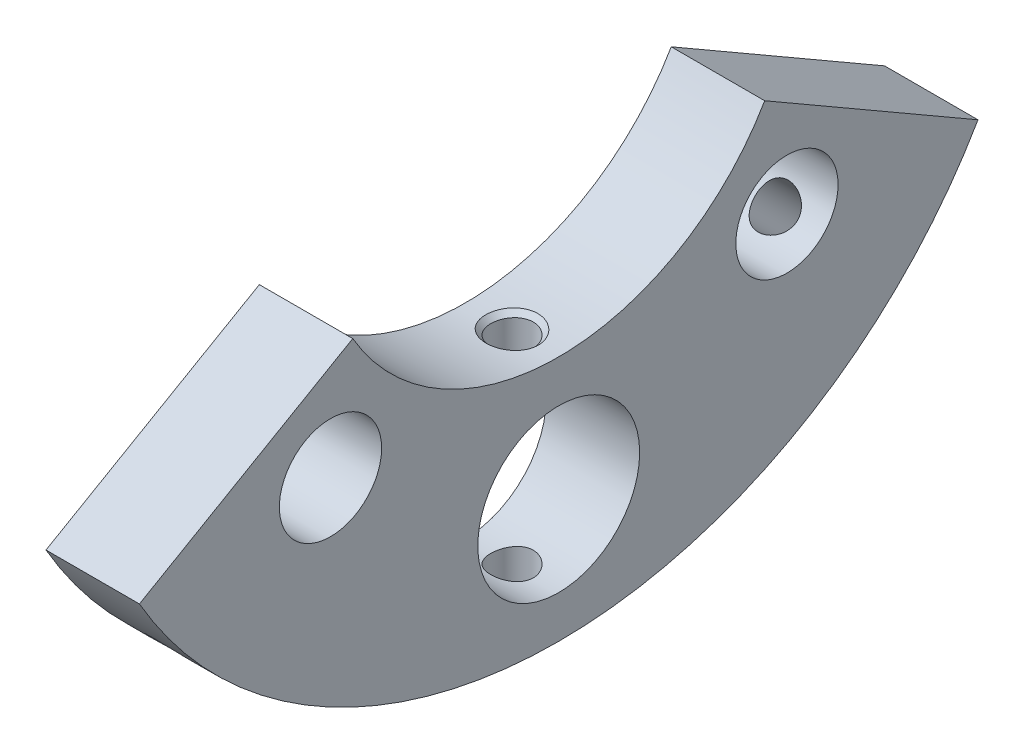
ISO-10303-21;
HEADER;
FILE_DESCRIPTION(('STEP AP214'),'2;1');
FILE_NAME('part.step','',(''),(''),'','','');
FILE_SCHEMA(('AUTOMOTIVE_DESIGN { 1 0 10303 214 1 1 1 1 }'));
ENDSEC;
DATA;
#1=APPLICATION_CONTEXT('core data for automotive mechanical design processes');
#2=APPLICATION_PROTOCOL_DEFINITION('international standard','automotive_design',2000,#1);
#3=PRODUCT_CONTEXT('',#1,'mechanical');
#4=PRODUCT('Part','Part','',(#3));
#5=PRODUCT_RELATED_PRODUCT_CATEGORY('part','',(#4));
#6=PRODUCT_DEFINITION_FORMATION('','',#4);
#7=PRODUCT_DEFINITION_CONTEXT('part definition',#1,'design');
#8=PRODUCT_DEFINITION('design','',#6,#7);
#9=PRODUCT_DEFINITION_SHAPE('','',#8);
#10=(LENGTH_UNIT() NAMED_UNIT(*) SI_UNIT(.MILLI.,.METRE.));
#11=(NAMED_UNIT(*) PLANE_ANGLE_UNIT() SI_UNIT($,.RADIAN.));
#12=(NAMED_UNIT(*) SI_UNIT($,.STERADIAN.) SOLID_ANGLE_UNIT());
#13=UNCERTAINTY_MEASURE_WITH_UNIT(LENGTH_MEASURE(1.E-05),#10,'distance_accuracy_value','');
#14=(GEOMETRIC_REPRESENTATION_CONTEXT(3) GLOBAL_UNCERTAINTY_ASSIGNED_CONTEXT((#13)) GLOBAL_UNIT_ASSIGNED_CONTEXT((#10,
#11,#12)) REPRESENTATION_CONTEXT('',''));
#15=CARTESIAN_POINT('',(0.,0.,0.));
#16=DIRECTION('',(0.,0.,1.));
#17=DIRECTION('',(1.,0.,0.));
#18=AXIS2_PLACEMENT_3D('',#15,#16,#17);
#19=CARTESIAN_POINT('',(2.75,0.,0.));
#20=DIRECTION('',(1.,0.,0.));
#21=DIRECTION('',(0.,0.,-1.));
#22=AXIS2_PLACEMENT_3D('',#19,#20,#21);
#23=PLANE('',#22);
#24=CARTESIAN_POINT('',(2.75,-13.4350576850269,13.435));
#25=DIRECTION('',(1.,0.,0.));
#26=DIRECTION('',(0.,0.,-1.));
#27=AXIS2_PLACEMENT_3D('',#24,#25,#26);
#28=CIRCLE('',#27,3.01);
#29=CARTESIAN_POINT('',(2.75,-13.4350576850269,10.425));
#30=VERTEX_POINT('',#29);
#31=EDGE_CURVE('E150',#30,#30,#28,.T.);
#32=ORIENTED_EDGE('',*,*,#31,.F.);
#33=EDGE_LOOP('',(#32));
#34=FACE_BOUND('',#33,.T.);
#35=CARTESIAN_POINT('',(2.75,-13.4350576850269,-13.435));
#36=DIRECTION('',(1.,0.,0.));
#37=DIRECTION('',(0.,0.,-1.));
#38=AXIS2_PLACEMENT_3D('',#35,#36,#37);
#39=CIRCLE('',#38,3.00999999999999);
#40=CARTESIAN_POINT('',(2.75,-13.4350576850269,-16.445));
#41=VERTEX_POINT('',#40);
#42=EDGE_CURVE('E209',#41,#41,#39,.T.);
#43=ORIENTED_EDGE('',*,*,#42,.F.);
#44=EDGE_LOOP('',(#43));
#45=FACE_BOUND('',#44,.T.);
#46=CARTESIAN_POINT('',(2.75,-21.25,0.));
#47=DIRECTION('',(1.,0.,0.));
#48=DIRECTION('',(0.,0.,-1.));
#49=AXIS2_PLACEMENT_3D('',#46,#47,#48);
#50=CIRCLE('',#49,4.765);
#51=CARTESIAN_POINT('',(2.75,-21.25,-4.765));
#52=VERTEX_POINT('',#51);
#53=EDGE_CURVE('E203',#52,#52,#50,.T.);
#54=ORIENTED_EDGE('',*,*,#53,.F.);
#55=EDGE_LOOP('',(#54));
#56=FACE_BOUND('',#55,.T.);
#57=DIRECTION('',(0.,0.499999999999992,-0.866025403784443));
#58=VECTOR('',#57,1.);
#59=CARTESIAN_POINT('',(2.75,-6.2499999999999,10.8253175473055));
#60=LINE('',#59,#58);
#61=CARTESIAN_POINT('',(2.75,-14.2499999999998,24.6817240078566));
#62=VERTEX_POINT('',#61);
#63=CARTESIAN_POINT('',(2.75,-6.99999999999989,12.1243556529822));
#64=VERTEX_POINT('',#63);
#65=EDGE_CURVE('E64',#62,#64,#60,.T.);
#66=ORIENTED_EDGE('',*,*,#65,.F.);
#67=CARTESIAN_POINT('',(2.75,0.,0.));
#68=DIRECTION('',(1.,0.,0.));
#69=DIRECTION('',(0.,0.,-1.));
#70=AXIS2_PLACEMENT_3D('',#67,#68,#69);
#71=CIRCLE('',#70,28.5);
#72=CARTESIAN_POINT('',(2.75,-14.2500000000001,-24.6817240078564));
#73=VERTEX_POINT('',#72);
#74=EDGE_CURVE('E107',#62,#73,#71,.T.);
#75=ORIENTED_EDGE('',*,*,#74,.T.);
#76=DIRECTION('',(0.,-0.500000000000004,-0.866025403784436));
#77=VECTOR('',#76,1.);
#78=CARTESIAN_POINT('',(2.75,-6.25000000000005,-10.8253175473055));
#79=LINE('',#78,#77);
#80=CARTESIAN_POINT('',(2.75,-7.00000000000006,-12.1243556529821));
#81=VERTEX_POINT('',#80);
#82=EDGE_CURVE('E98',#81,#73,#79,.T.);
#83=ORIENTED_EDGE('',*,*,#82,.F.);
#84=CARTESIAN_POINT('',(2.75,0.,0.));
#85=DIRECTION('',(1.,0.,0.));
#86=DIRECTION('',(0.,0.,-1.));
#87=AXIS2_PLACEMENT_3D('',#84,#85,#86);
#88=CIRCLE('',#87,14.);
#89=EDGE_CURVE('E102',#64,#81,#88,.T.);
#90=ORIENTED_EDGE('',*,*,#89,.F.);
#91=EDGE_LOOP('',(#66,#75,#83,#90));
#92=FACE_BOUND('',#91,.T.);
#93=ADVANCED_FACE('F36',(#34,#45,#56,#92),#23,.T.);
#94=CARTESIAN_POINT('',(-2.75,0.,0.));
#95=DIRECTION('',(1.,0.,0.));
#96=DIRECTION('',(0.,0.,-1.));
#97=AXIS2_PLACEMENT_3D('',#94,#95,#96);
#98=PLANE('',#97);
#99=CARTESIAN_POINT('',(-2.75,-13.4350576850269,13.435));
#100=DIRECTION('',(1.,0.,0.));
#101=DIRECTION('',(0.,0.,-1.));
#102=AXIS2_PLACEMENT_3D('',#99,#100,#101);
#103=CIRCLE('',#102,3.01);
#104=CARTESIAN_POINT('',(-2.75,-13.4350576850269,10.425));
#105=VERTEX_POINT('',#104);
#106=EDGE_CURVE('E211',#105,#105,#103,.F.);
#107=ORIENTED_EDGE('',*,*,#106,.F.);
#108=EDGE_LOOP('',(#107));
#109=FACE_BOUND('',#108,.T.);
#110=CARTESIAN_POINT('',(-2.75,-13.4350576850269,-13.435));
#111=DIRECTION('',(1.,0.,0.));
#112=DIRECTION('',(0.,0.,-1.));
#113=AXIS2_PLACEMENT_3D('',#110,#111,#112);
#114=CIRCLE('',#113,3.00999999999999);
#115=CARTESIAN_POINT('',(-2.75,-13.4350576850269,-16.445));
#116=VERTEX_POINT('',#115);
#117=EDGE_CURVE('E206',#116,#116,#114,.F.);
#118=ORIENTED_EDGE('',*,*,#117,.F.);
#119=EDGE_LOOP('',(#118));
#120=FACE_BOUND('',#119,.T.);
#121=CARTESIAN_POINT('',(-2.75,-21.25,0.));
#122=DIRECTION('',(1.,0.,0.));
#123=DIRECTION('',(0.,0.,-1.));
#124=AXIS2_PLACEMENT_3D('',#121,#122,#123);
#125=CIRCLE('',#124,4.765);
#126=CARTESIAN_POINT('',(-2.75,-21.25,-4.765));
#127=VERTEX_POINT('',#126);
#128=EDGE_CURVE('E200',#127,#127,#125,.F.);
#129=ORIENTED_EDGE('',*,*,#128,.F.);
#130=EDGE_LOOP('',(#129));
#131=FACE_BOUND('',#130,.T.);
#132=CARTESIAN_POINT('',(-2.75,0.,0.));
#133=DIRECTION('',(1.,0.,0.));
#134=DIRECTION('',(0.,0.,-1.));
#135=AXIS2_PLACEMENT_3D('',#132,#133,#134);
#136=CIRCLE('',#135,28.5);
#137=CARTESIAN_POINT('',(-2.75,-14.2499999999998,24.6817240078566));
#138=VERTEX_POINT('',#137);
#139=CARTESIAN_POINT('',(-2.75,-14.2500000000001,-24.6817240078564));
#140=VERTEX_POINT('',#139);
#141=EDGE_CURVE('E97',#138,#140,#136,.T.);
#142=ORIENTED_EDGE('',*,*,#141,.F.);
#143=DIRECTION('',(0.,-0.499999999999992,0.866025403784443));
#144=VECTOR('',#143,1.);
#145=CARTESIAN_POINT('',(-2.75,-6.2499999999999,10.8253175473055));
#146=LINE('',#145,#144);
#147=CARTESIAN_POINT('',(-2.75,-6.99999999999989,12.1243556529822));
#148=VERTEX_POINT('',#147);
#149=EDGE_CURVE('E82',#148,#138,#146,.T.);
#150=ORIENTED_EDGE('',*,*,#149,.F.);
#151=CARTESIAN_POINT('',(-2.75,0.,0.));
#152=DIRECTION('',(1.,0.,0.));
#153=DIRECTION('',(0.,0.,-1.));
#154=AXIS2_PLACEMENT_3D('',#151,#152,#153);
#155=CIRCLE('',#154,14.);
#156=CARTESIAN_POINT('',(-2.75,-7.00000000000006,-12.1243556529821));
#157=VERTEX_POINT('',#156);
#158=EDGE_CURVE('E95',#148,#157,#155,.T.);
#159=ORIENTED_EDGE('',*,*,#158,.T.);
#160=DIRECTION('',(0.,0.500000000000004,0.866025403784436));
#161=VECTOR('',#160,1.);
#162=CARTESIAN_POINT('',(-2.75,-6.25000000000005,-10.8253175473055));
#163=LINE('',#162,#161);
#164=EDGE_CURVE('E56',#140,#157,#163,.T.);
#165=ORIENTED_EDGE('',*,*,#164,.F.);
#166=EDGE_LOOP('',(#142,#150,#159,#165));
#167=FACE_BOUND('',#166,.T.);
#168=ADVANCED_FACE('F94',(#109,#120,#131,#167),#98,.F.);
#169=CARTESIAN_POINT('',(2.75,0.,0.));
#170=DIRECTION('',(-1.,0.,0.));
#171=DIRECTION('',(0.,0.,1.));
#172=AXIS2_PLACEMENT_3D('',#169,#170,#171);
#173=CYLINDRICAL_SURFACE('',#172,28.5);
#174=CARTESIAN_POINT('',(0.,-19.2492971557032,21.0170064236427));
#175=CARTESIAN_POINT('',(0.0701768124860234,-19.2492996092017,21.0170044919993));
#176=CARTESIAN_POINT('',(0.14040365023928,-19.2536754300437,21.0129989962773));
#177=CARTESIAN_POINT('',(0.278920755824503,-19.2710544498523,20.9970615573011));
#178=CARTESIAN_POINT('',(0.347208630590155,-19.2840678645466,20.9851202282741));
#179=CARTESIAN_POINT('',(0.4798211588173,-19.3183037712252,20.9536077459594));
#180=CARTESIAN_POINT('',(0.544147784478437,-19.3395221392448,20.9340404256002));
#181=CARTESIAN_POINT('',(0.667029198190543,-19.389489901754,20.8877675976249));
#182=CARTESIAN_POINT('',(0.725585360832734,-19.4182374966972,20.8610637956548));
#183=CARTESIAN_POINT('',(0.835328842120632,-19.4823878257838,20.8011654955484));
#184=CARTESIAN_POINT('',(0.88651093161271,-19.5177952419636,20.767966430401));
#185=CARTESIAN_POINT('',(0.980008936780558,-19.5941574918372,20.6959353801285));
#186=CARTESIAN_POINT('',(1.02232449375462,-19.6351125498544,20.657103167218));
#187=CARTESIAN_POINT('',(1.09690134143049,-19.7213366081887,20.5748008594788));
#188=CARTESIAN_POINT('',(1.12915875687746,-19.7666072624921,20.531328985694));
#189=CARTESIAN_POINT('',(1.18267872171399,-19.8600889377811,20.4409170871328));
#190=CARTESIAN_POINT('',(1.20394134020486,-19.9082999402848,20.3939770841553));
#191=CARTESIAN_POINT('',(1.23485487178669,-20.0062070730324,20.2979401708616));
#192=CARTESIAN_POINT('',(1.24451331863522,-20.0559022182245,20.2488446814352));
#193=CARTESIAN_POINT('',(1.25196758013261,-20.1553697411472,20.1498385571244));
#194=CARTESIAN_POINT('',(1.24976347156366,-20.2051421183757,20.0999279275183));
#195=CARTESIAN_POINT('',(1.23356146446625,-20.3033211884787,20.0007503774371));
#196=CARTESIAN_POINT('',(1.21957167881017,-20.3517287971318,19.9514830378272));
#197=CARTESIAN_POINT('',(1.18020800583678,-20.4458772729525,19.8549905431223));
#198=CARTESIAN_POINT('',(1.15483407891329,-20.4916181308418,19.8077653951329));
#199=CARTESIAN_POINT('',(1.09341312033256,-20.5792152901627,19.716741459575));
#200=CARTESIAN_POINT('',(1.0573623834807,-20.6210702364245,19.6729438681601));
#201=CARTESIAN_POINT('',(0.975613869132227,-20.6997753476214,19.5901140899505));
#202=CARTESIAN_POINT('',(0.929916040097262,-20.7366254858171,19.5510819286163));
#203=CARTESIAN_POINT('',(0.83012464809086,-20.8043992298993,19.4789483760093));
#204=CARTESIAN_POINT('',(0.776024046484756,-20.8353178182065,19.4458520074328));
#205=CARTESIAN_POINT('',(0.660987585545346,-20.8904049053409,19.386660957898));
#206=CARTESIAN_POINT('',(0.600051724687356,-20.9145734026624,19.3605662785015));
#207=CARTESIAN_POINT('',(0.473070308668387,-20.9555551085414,19.3162011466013));
#208=CARTESIAN_POINT('',(0.407024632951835,-20.9723681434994,19.297930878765));
#209=CARTESIAN_POINT('',(0.271700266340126,-20.9982200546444,19.269798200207));
#210=CARTESIAN_POINT('',(0.202421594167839,-21.0072589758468,19.2599357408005));
#211=CARTESIAN_POINT('',(0.0626596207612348,-21.0173349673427,19.2489399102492));
#212=CARTESIAN_POINT('',(-0.007822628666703,-21.0183786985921,19.2477992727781));
#213=CARTESIAN_POINT('',(-0.148045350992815,-21.0124561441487,19.2542645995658));
#214=CARTESIAN_POINT('',(-0.217785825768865,-21.0054898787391,19.2618705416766));
#215=CARTESIAN_POINT('',(-0.354517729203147,-20.9837236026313,19.2855801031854));
#216=CARTESIAN_POINT('',(-0.421510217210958,-20.9689266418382,19.3016804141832));
#217=CARTESIAN_POINT('',(-0.550877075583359,-20.9318671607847,19.3418634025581));
#218=CARTESIAN_POINT('',(-0.613251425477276,-20.9096046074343,19.365946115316));
#219=CARTESIAN_POINT('',(-0.731656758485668,-20.858151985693,19.4213521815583));
#220=CARTESIAN_POINT('',(-0.787683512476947,-20.8289573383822,19.452680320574));
#221=CARTESIAN_POINT('',(-0.891760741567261,-20.76438578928,19.521590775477));
#222=CARTESIAN_POINT('',(-0.939811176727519,-20.7290088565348,19.5591731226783));
#223=CARTESIAN_POINT('',(-1.02660481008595,-20.6529549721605,19.6394629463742));
#224=CARTESIAN_POINT('',(-1.06534165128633,-20.6122744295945,19.6821738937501));
#225=CARTESIAN_POINT('',(-1.13236505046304,-20.5266995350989,19.7714041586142));
#226=CARTESIAN_POINT('',(-1.16065164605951,-20.4818051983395,19.8179234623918));
#227=CARTESIAN_POINT('',(-1.20596046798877,-20.3890251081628,19.9133643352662));
#228=CARTESIAN_POINT('',(-1.2229867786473,-20.3411404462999,19.9622850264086));
#229=CARTESIAN_POINT('',(-1.24530509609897,-20.2436818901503,20.0611105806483));
#230=CARTESIAN_POINT('',(-1.25059714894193,-20.1941080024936,20.1110154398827));
#231=CARTESIAN_POINT('',(-1.24929626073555,-20.0947089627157,20.2103340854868));
#232=CARTESIAN_POINT('',(-1.24271330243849,-20.0448840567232,20.2597482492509));
#233=CARTESIAN_POINT('',(-1.21786986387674,-19.9463734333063,20.3567425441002));
#234=CARTESIAN_POINT('',(-1.19960936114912,-19.8976877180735,20.4043226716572));
#235=CARTESIAN_POINT('',(-1.15193109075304,-19.8028822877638,20.4963465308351));
#236=CARTESIAN_POINT('',(-1.1225131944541,-19.7567626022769,20.54079022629));
#237=CARTESIAN_POINT('',(-1.05335722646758,-19.6684674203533,20.6253516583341));
#238=CARTESIAN_POINT('',(-1.01361949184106,-19.626291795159,20.6654695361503));
#239=CARTESIAN_POINT('',(-0.924917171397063,-19.5471328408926,20.7403609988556));
#240=CARTESIAN_POINT('',(-0.875945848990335,-19.5101533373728,20.7751306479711));
#241=CARTESIAN_POINT('',(-0.770166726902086,-19.4425549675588,20.8384070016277));
#242=CARTESIAN_POINT('',(-0.713356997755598,-19.4119376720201,20.8669121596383));
#243=CARTESIAN_POINT('',(-0.593477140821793,-19.3580107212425,20.9169495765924));
#244=CARTESIAN_POINT('',(-0.53040175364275,-19.3347072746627,20.9384759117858));
#245=CARTESIAN_POINT('',(-0.399866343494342,-19.296203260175,20.9739655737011));
#246=CARTESIAN_POINT('',(-0.332411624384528,-19.2809930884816,20.987937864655));
#247=CARTESIAN_POINT('',(-0.220446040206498,-19.2631656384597,21.0042979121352));
#248=CARTESIAN_POINT('',(-0.176660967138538,-19.2579722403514,21.0090582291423));
#249=CARTESIAN_POINT('',(-0.0885905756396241,-19.2510372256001,21.0154130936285));
#250=CARTESIAN_POINT('',(-0.0443052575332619,-19.2492956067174,21.0170076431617));
#251=CARTESIAN_POINT('',(0.,-19.2492971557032,21.0170064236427));
#252=B_SPLINE_CURVE_WITH_KNOTS('',3,(#174,#175,#176,#177,#178,#179,#180,#181,#182,#183,#184,
#185,#186,#187,#188,#189,#190,#191,#192,#193,#194,#195,#196,#197,#198,#199,#200,#201,#202,#203,
#204,#205,#206,#207,#208,#209,#210,#211,#212,#213,#214,#215,#216,#217,#218,#219,#220,#221,#222,
#223,#224,#225,#226,#227,#228,#229,#230,#231,#232,#233,#234,#235,#236,#237,#238,#239,#240,#241,
#242,#243,#244,#245,#246,#247,#248,#249,#250,#251),.UNSPECIFIED.,.T.,.F.,(4,2,2,2,2,2,2,2,2,2,2,
2,2,2,2,2,2,2,2,2,2,2,2,2,2,2,2,2,2,2,2,2,2,2,2,2,2,2,4),(0.,0.210368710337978,0.42098666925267,
0.631498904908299,0.841960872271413,1.05257135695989,1.26319036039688,1.47389041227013,
1.68458913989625,1.89515100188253,2.10571150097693,2.31612717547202,2.52654358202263,
2.73703309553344,2.94752373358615,3.15819165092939,3.36885961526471,3.57953255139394,
3.79020426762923,4.0007004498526,4.21119609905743,4.42160982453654,4.63202448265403,
4.84257851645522,5.05313360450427,5.26383200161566,5.47452964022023,5.68515081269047,
5.89577115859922,6.10621452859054,6.31665830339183,6.52710450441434,6.73754383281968,
6.94813729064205,7.15878267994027,7.3696064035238,7.58017939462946,7.71299314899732,
7.84580681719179),.UNSPECIFIED.);
#253=CARTESIAN_POINT('',(0.,-19.2492971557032,21.0170064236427));
#254=VERTEX_POINT('',#253);
#255=EDGE_CURVE('E168',#254,#254,#252,.T.);
#256=ORIENTED_EDGE('',*,*,#255,.T.);
#257=EDGE_LOOP('',(#256));
#258=FACE_BOUND('',#257,.T.);
#259=CARTESIAN_POINT('',(0.,-21.0170615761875,-19.2492369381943));
#260=CARTESIAN_POINT('',(0.070176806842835,-21.0170596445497,-19.2492393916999));
#261=CARTESIAN_POINT('',(0.140403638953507,-21.0130541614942,-19.2536152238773));
#262=CARTESIAN_POINT('',(0.278920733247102,-20.997116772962,-19.2709942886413));
#263=CARTESIAN_POINT('',(0.347208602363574,-20.9851754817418,-19.2840077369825));
#264=CARTESIAN_POINT('',(0.479821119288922,-20.9536630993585,-19.3182437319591));
#265=CARTESIAN_POINT('',(0.544147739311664,-20.9340958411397,-19.3394621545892));
#266=CARTESIAN_POINT('',(0.667029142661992,-20.8878231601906,-19.3894300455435));
#267=CARTESIAN_POINT('',(0.725585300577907,-20.8611194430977,-19.4181777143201));
#268=CARTESIAN_POINT('',(0.835328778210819,-20.8012213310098,-19.482328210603));
#269=CARTESIAN_POINT('',(0.886510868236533,-20.7680223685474,-19.5177357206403));
#270=CARTESIAN_POINT('',(0.980008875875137,-20.6959915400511,-19.5940981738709));
#271=CARTESIAN_POINT('',(1.02232443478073,-20.6571594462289,-19.6350533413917));
#272=CARTESIAN_POINT('',(1.09690129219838,-20.5748573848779,-19.7212776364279));
#273=CARTESIAN_POINT('',(1.12915871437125,-20.5313856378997,-19.7665484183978));
#274=CARTESIAN_POINT('',(1.18267869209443,-20.4409740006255,-19.8600303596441));
#275=CARTESIAN_POINT('',(1.20394131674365,-20.3940341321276,-19.9082415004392));
#276=CARTESIAN_POINT('',(1.23485485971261,-20.297997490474,-20.0061489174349));
#277=CARTESIAN_POINT('',(1.24451331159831,-20.2489021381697,-20.0558442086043));
#278=CARTESIAN_POINT('',(1.25196758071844,-20.1498962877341,-20.155312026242));
#279=CARTESIAN_POINT('',(1.24976347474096,-20.0999857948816,-20.2050845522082));
#280=CARTESIAN_POINT('',(1.23356147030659,-20.0008085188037,-20.3032639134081));
#281=CARTESIAN_POINT('',(1.21957168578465,-19.9515413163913,-20.3516716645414));
#282=CARTESIAN_POINT('',(1.18020801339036,-19.8550490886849,-20.445820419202));
#283=CARTESIAN_POINT('',(1.15483408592,-19.8078240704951,-20.4915614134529));
#284=CARTESIAN_POINT('',(1.09341312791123,-19.7168003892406,-20.5791588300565));
#285=CARTESIAN_POINT('',(1.05736239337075,-19.6730029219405,-20.6210138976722));
#286=CARTESIAN_POINT('',(0.975613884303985,-19.5901733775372,-20.6997192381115));
#287=CARTESIAN_POINT('',(0.929916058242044,-19.5511413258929,-20.736569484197));
#288=CARTESIAN_POINT('',(0.830124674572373,-19.4790079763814,-20.8043434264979));
#289=CARTESIAN_POINT('',(0.776024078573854,-19.4459117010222,-20.8352621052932));
#290=CARTESIAN_POINT('',(0.660987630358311,-19.3867208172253,-20.8903493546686));
#291=CARTESIAN_POINT('',(0.600051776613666,-19.3606262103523,-20.9145179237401));
#292=CARTESIAN_POINT('',(0.473070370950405,-19.3162611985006,-20.9554997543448));
#293=CARTESIAN_POINT('',(0.407024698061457,-19.297990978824,-20.9723128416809));
#294=CARTESIAN_POINT('',(0.271700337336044,-19.269858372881,-20.9981648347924));
#295=CARTESIAN_POINT('',(0.202421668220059,-19.2599959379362,-21.0072037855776));
#296=CARTESIAN_POINT('',(0.0626596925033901,-19.2490001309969,-21.0172798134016));
#297=CARTESIAN_POINT('',(-0.00782256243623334,-19.2478594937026,-21.0183235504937));
#298=CARTESIAN_POINT('',(-0.148045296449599,-19.2543247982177,-21.0124009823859));
#299=CARTESIAN_POINT('',(-0.217785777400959,-19.2619307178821,-21.0054346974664));
#300=CARTESIAN_POINT('',(-0.354517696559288,-19.2856402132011,-20.9836683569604));
#301=CARTESIAN_POINT('',(-0.421510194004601,-19.3017404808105,-20.9688713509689));
#302=CARTESIAN_POINT('',(-0.550877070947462,-19.3419233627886,-20.9318117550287));
#303=CARTESIAN_POINT('',(-0.613251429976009,-19.3660060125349,-20.9095491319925));
#304=CARTESIAN_POINT('',(-0.731656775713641,-19.421411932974,-20.8580963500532));
#305=CARTESIAN_POINT('',(-0.787683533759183,-19.4527399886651,-20.8289016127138));
#306=CARTESIAN_POINT('',(-0.891760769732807,-19.5216502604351,-20.7643298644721));
#307=CARTESIAN_POINT('',(-0.939811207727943,-19.5592325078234,-20.7289528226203));
#308=CARTESIAN_POINT('',(-1.02660483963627,-19.6395221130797,-20.6528987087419));
#309=CARTESIAN_POINT('',(-1.0653416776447,-19.6822329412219,-20.6122180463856));
#310=CARTESIAN_POINT('',(-1.13236507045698,-19.7714629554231,-20.5266429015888));
#311=CARTESIAN_POINT('',(-1.16065166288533,-19.8179821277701,-20.4817484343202));
#312=CARTESIAN_POINT('',(-1.20596047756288,-19.9134227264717,-20.3889680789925));
#313=CARTESIAN_POINT('',(-1.22298678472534,-19.9623432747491,-20.3410832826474));
#314=CARTESIAN_POINT('',(-1.24530509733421,-20.0611685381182,-20.2436244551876));
#315=CARTESIAN_POINT('',(-1.25059714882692,-20.1110732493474,-20.1940504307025));
#316=CARTESIAN_POINT('',(-1.24929626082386,-20.2103916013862,-20.094651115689));
#317=CARTESIAN_POINT('',(-1.24271330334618,-20.2598056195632,-20.0448260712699));
#318=CARTESIAN_POINT('',(-1.21786986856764,-20.3567996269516,-19.9463151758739));
#319=CARTESIAN_POINT('',(-1.19960936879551,-20.4043796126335,-19.8976293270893));
#320=CARTESIAN_POINT('',(-1.15193110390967,-20.4964032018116,-19.802823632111));
#321=CARTESIAN_POINT('',(-1.12251320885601,-20.5408467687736,-19.7567038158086));
#322=CARTESIAN_POINT('',(-1.05335724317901,-20.6254079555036,-19.668408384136));
#323=CARTESIAN_POINT('',(-1.01361950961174,-20.665525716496,-19.6262326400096));
#324=CARTESIAN_POINT('',(-0.92491718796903,-20.7404169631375,-19.5470734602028));
#325=CARTESIAN_POINT('',(-0.875945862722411,-20.7751865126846,-19.5100938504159));
#326=CARTESIAN_POINT('',(-0.770166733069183,-20.8384626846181,-19.4424952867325));
#327=CARTESIAN_POINT('',(-0.713356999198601,-20.8669677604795,-19.411877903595));
#328=CARTESIAN_POINT('',(-0.593477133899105,-20.9170050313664,-19.3579508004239));
#329=CARTESIAN_POINT('',(-0.530401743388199,-20.9385313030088,-19.3346472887));
#330=CARTESIAN_POINT('',(-0.399866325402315,-20.9740208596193,-19.2961431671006));
#331=CARTESIAN_POINT('',(-0.332411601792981,-20.9879931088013,-19.2809329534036));
#332=CARTESIAN_POINT('',(-0.220446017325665,-21.0043531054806,-19.2631054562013));
#333=CARTESIAN_POINT('',(-0.176660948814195,-21.0091134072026,-19.2579120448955));
#334=CARTESIAN_POINT('',(-0.0885905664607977,-21.0154682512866,-19.2509770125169));
#335=CARTESIAN_POINT('',(-0.0443052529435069,-21.017062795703,-19.2492353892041));
#336=CARTESIAN_POINT('',(0.,-21.0170615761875,-19.2492369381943));
#337=B_SPLINE_CURVE_WITH_KNOTS('',3,(#259,#260,#261,#262,#263,#264,#265,#266,#267,#268,#269,
#270,#271,#272,#273,#274,#275,#276,#277,#278,#279,#280,#281,#282,#283,#284,#285,#286,#287,#288,
#289,#290,#291,#292,#293,#294,#295,#296,#297,#298,#299,#300,#301,#302,#303,#304,#305,#306,#307,
#308,#309,#310,#311,#312,#313,#314,#315,#316,#317,#318,#319,#320,#321,#322,#323,#324,#325,#326,
#327,#328,#329,#330,#331,#332,#333,#334,#335,#336),.UNSPECIFIED.,.T.,.F.,(4,2,2,2,2,2,2,2,2,2,2,
2,2,2,2,2,2,2,2,2,2,2,2,2,2,2,2,2,2,2,2,2,2,2,2,2,2,2,4),(0.,0.210368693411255,0.42098663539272,
0.631498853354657,0.841960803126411,1.05257128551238,1.26319028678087,1.47389035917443,
1.68458910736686,1.89515099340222,2.10571151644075,2.31612719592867,2.52654360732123,
2.73703310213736,2.94752372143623,3.15819161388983,3.36885955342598,3.57953248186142,
3.79020419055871,4.00070038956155,4.21119605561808,4.42160980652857,4.63202449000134,
4.84257853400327,5.05313363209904,5.26383201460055,5.47452963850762,5.68515078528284,
5.89577110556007,6.10621446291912,6.31665822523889,6.52710443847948,6.73754377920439,
6.94813726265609,7.15878267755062,7.36960641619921,7.58017942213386,7.71299316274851,
7.84580681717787),.UNSPECIFIED.);
#338=CARTESIAN_POINT('',(0.,-21.0170615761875,-19.2492369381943));
#339=VERTEX_POINT('',#338);
#340=EDGE_CURVE('E163',#339,#339,#337,.T.);
#341=ORIENTED_EDGE('',*,*,#340,.T.);
#342=EDGE_LOOP('',(#341));
#343=FACE_BOUND('',#342,.T.);
#344=CARTESIAN_POINT('',(-1.24999999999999,-28.5,0.));
#345=CARTESIAN_POINT('',(-1.24999689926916,-28.4999996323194,0.0701768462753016));
#346=CARTESIAN_POINT('',(-1.24407040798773,-28.4997380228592,0.140403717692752));
#347=CARTESIAN_POINT('',(-1.22051209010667,-28.4987195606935,0.278920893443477));
#348=CARTESIAN_POINT('',(-1.20286640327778,-28.4979621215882,0.347208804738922));
#349=CARTESIAN_POINT('',(-1.15637521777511,-28.4960377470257,0.479821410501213));
#350=CARTESIAN_POINT('',(-1.12753534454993,-28.4948710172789,0.544148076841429));
#351=CARTESIAN_POINT('',(-1.059482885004,-28.4922595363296,0.667029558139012));
#352=CARTESIAN_POINT('',(-1.02027277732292,-28.4908148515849,0.725585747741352));
#353=CARTESIAN_POINT('',(-0.932557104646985,-28.4878087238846,0.835329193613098));
#354=CARTESIAN_POINT('',(-0.884045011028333,-28.4862471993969,0.886511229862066));
#355=CARTESIAN_POINT('',(-0.779115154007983,-28.4831840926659,0.980009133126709));
#356=CARTESIAN_POINT('',(-0.722697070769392,-28.4816825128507,1.022324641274));
#357=CARTESIAN_POINT('',(-0.603530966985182,-28.4789080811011,1.09690144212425));
#358=CARTESIAN_POINT('',(-0.540780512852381,-28.4776353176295,1.1291588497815));
#359=CARTESIAN_POINT('',(-0.410748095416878,-28.4754629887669,1.18267879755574));
#360=CARTESIAN_POINT('',(-0.343466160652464,-28.4745634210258,1.20394140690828));
#361=CARTESIAN_POINT('',(-0.206326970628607,-28.4732396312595,1.23485491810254));
#362=CARTESIAN_POINT('',(-0.136471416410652,-28.4728151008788,1.24451335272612));
#363=CARTESIAN_POINT('',(0.00387069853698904,-28.4724883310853,1.25196758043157));
#364=CARTESIAN_POINT('',(0.0743572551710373,-28.472586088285,1.24976345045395));
#365=CARTESIAN_POINT('',(0.21390936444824,-28.4732925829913,1.23356140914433));
#366=CARTESIAN_POINT('',(0.282975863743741,-28.4739009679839,1.21957163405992));
#367=CARTESIAN_POINT('',(0.417779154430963,-28.4755595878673,1.18020802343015));
#368=CARTESIAN_POINT('',(0.48351593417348,-28.476609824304,1.15483414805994));
#369=CARTESIAN_POINT('',(0.609819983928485,-28.4790341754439,1.09341329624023));
#370=CARTESIAN_POINT('',(0.670385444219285,-28.4804084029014,1.05736260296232));
#371=CARTESIAN_POINT('',(0.784607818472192,-28.4833257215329,0.975614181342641));
#372=CARTESIAN_POINT('',(0.83826469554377,-28.4848688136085,0.929916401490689));
#373=CARTESIAN_POINT('',(0.937194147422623,-28.4879514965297,0.830125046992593));
#374=CARTESIAN_POINT('',(0.982459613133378,-28.4894910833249,0.776024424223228));
#375=CARTESIAN_POINT('',(1.06326655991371,-28.4923919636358,0.660987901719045));
#376=CARTESIAN_POINT('',(1.09880803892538,-28.4937532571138,0.600052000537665));
#377=CARTESIAN_POINT('',(1.15915740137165,-28.4961441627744,0.473070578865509));
#378=CARTESIAN_POINT('',(1.18396504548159,-28.4971737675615,0.407024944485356));
#379=CARTESIAN_POINT('',(1.22213793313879,-28.4987851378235,0.271700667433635));
#380=CARTESIAN_POINT('',(1.23550324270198,-28.4993669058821,0.202422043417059));
#381=CARTESIAN_POINT('',(1.25040332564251,-28.5000167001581,0.0626600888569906));
#382=CARTESIAN_POINT('',(1.25194793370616,-28.5000851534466,-0.00782219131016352));
#383=CARTESIAN_POINT('',(1.24318842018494,-28.4997017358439,-0.14804498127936));
#384=CARTESIAN_POINT('',(1.23288432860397,-28.4992498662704,-0.217785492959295));
#385=CARTESIAN_POINT('',(1.20072805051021,-28.4978769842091,-0.354517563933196));
#386=CARTESIAN_POINT('',(1.17888034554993,-28.49695615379,-0.421510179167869));
#387=CARTESIAN_POINT('',(1.12426155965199,-28.4947490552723,-0.55087727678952));
#388=CARTESIAN_POINT('',(1.09149043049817,-28.4934627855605,-0.613251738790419));
#389=CARTESIAN_POINT('',(1.01592981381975,-28.4906685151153,-0.731657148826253));
#390=CARTESIAN_POINT('',(0.973133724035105,-28.4891603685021,-0.787683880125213));
#391=CARTESIAN_POINT('',(0.878747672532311,-28.4860927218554,-0.891761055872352));
#392=CARTESIAN_POINT('',(0.827157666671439,-28.4845332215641,-0.939811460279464));
#393=CARTESIAN_POINT('',(0.716605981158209,-28.4815374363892,-1.02660502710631));
#394=CARTESIAN_POINT('',(0.657639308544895,-28.4801012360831,-1.06534183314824));
#395=CARTESIAN_POINT('',(0.534033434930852,-28.4775153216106,-1.13236517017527));
#396=CARTESIAN_POINT('',(0.469394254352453,-28.4763656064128,-1.16065173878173));
#397=CARTESIAN_POINT('',(0.3363019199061,-28.474482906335,-1.20596053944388));
#398=CARTESIAN_POINT('',(0.267850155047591,-28.4737497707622,-1.2229868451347));
#399=CARTESIAN_POINT('',(0.129056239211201,-28.4727824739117,-1.24530513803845));
#400=CARTESIAN_POINT('',(0.0587140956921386,-28.4725483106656,-1.25059717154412));
#401=CARTESIAN_POINT('',(-0.0818004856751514,-28.4726054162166,-1.24929623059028));
#402=CARTESIAN_POINT('',(-0.151973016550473,-28.472896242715,-1.24271326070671));
#403=CARTESIAN_POINT('',(-0.290215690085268,-28.4739696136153,-1.21786983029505));
#404=CARTESIAN_POINT('',(-0.358285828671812,-28.4747521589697,-1.1996093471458));
#405=CARTESIAN_POINT('',(-0.49039391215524,-28.4767206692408,-1.15193114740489));
#406=CARTESIAN_POINT('',(-0.554431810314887,-28.4779066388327,-1.12251330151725));
#407=CARTESIAN_POINT('',(-0.676659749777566,-28.4805482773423,-1.05335745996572));
#408=CARTESIAN_POINT('',(-0.734849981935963,-28.4820039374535,-1.01361980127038));
#409=CARTESIAN_POINT('',(-0.84378008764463,-28.4850222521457,-0.924917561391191));
#410=CARTESIAN_POINT('',(-0.894514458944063,-28.4865849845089,-0.875946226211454));
#411=CARTESIAN_POINT('',(-0.987056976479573,-28.4896408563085,-0.770167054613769));
#412=CARTESIAN_POINT('',(-1.02886291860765,-28.4911339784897,-0.713357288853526));
#413=CARTESIAN_POINT('',(-1.10237688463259,-28.4938832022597,-0.593477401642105));
#414=CARTESIAN_POINT('',(-1.13407633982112,-28.4951391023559,-0.530402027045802));
#415=CARTESIAN_POINT('',(-1.18639779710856,-28.4972691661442,-0.399866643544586));
#416=CARTESIAN_POINT('',(-1.20703292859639,-28.4981437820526,-0.332411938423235));
#417=CARTESIAN_POINT('',(-1.23120717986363,-28.4991805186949,-0.220446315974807));
#418=CARTESIAN_POINT('',(-1.23824553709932,-28.4994864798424,-0.176661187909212));
#419=CARTESIAN_POINT('',(-1.24764292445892,-28.499896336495,-0.0885906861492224));
#420=CARTESIAN_POINT('',(-1.25000195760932,-28.5000002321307,-0.0443053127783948));
#421=CARTESIAN_POINT('',(-1.24999999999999,-28.5,0.));
#422=B_SPLINE_CURVE_WITH_KNOTS('',3,(#344,#345,#346,#347,#348,#349,#350,#351,#352,#353,#354,
#355,#356,#357,#358,#359,#360,#361,#362,#363,#364,#365,#366,#367,#368,#369,#370,#371,#372,#373,
#374,#375,#376,#377,#378,#379,#380,#381,#382,#383,#384,#385,#386,#387,#388,#389,#390,#391,#392,
#393,#394,#395,#396,#397,#398,#399,#400,#401,#402,#403,#404,#405,#406,#407,#408,#409,#410,#411,
#412,#413,#414,#415,#416,#417,#418,#419,#420,#421),.UNSPECIFIED.,.T.,.F.,(4,2,2,2,2,2,2,2,2,2,2,
2,2,2,2,2,2,2,2,2,2,2,2,2,2,2,2,2,2,2,2,2,2,2,2,2,2,2,4),(0.,0.210368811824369,
0.420986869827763,0.631499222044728,0.841961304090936,1.0525716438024,1.26319050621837,
1.47389062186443,1.68458941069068,1.89515135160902,2.10571192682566,2.31612726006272,
2.5265433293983,2.73703273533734,2.94752326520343,3.15819131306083,3.36885940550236,
3.57953219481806,3.79020376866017,4.00070004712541,4.21119579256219,4.42160987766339,
4.63202489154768,4.84257887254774,5.05313391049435,5.26383224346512,5.47452981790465,
5.68515112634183,5.89577160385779,6.10621471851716,6.31665824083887,6.52710420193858,
6.73754329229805,6.94813691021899,7.15878245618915,7.36960612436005,7.58017906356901,
7.712992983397,7.84580681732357),.UNSPECIFIED.);
#423=CARTESIAN_POINT('',(-1.24999999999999,-28.5,0.));
#424=VERTEX_POINT('',#423);
#425=EDGE_CURVE('E144',#424,#424,#422,.T.);
#426=ORIENTED_EDGE('',*,*,#425,.T.);
#427=EDGE_LOOP('',(#426));
#428=FACE_BOUND('',#427,.T.);
#429=ORIENTED_EDGE('',*,*,#74,.F.);
#430=DIRECTION('',(-1.,0.,0.));
#431=VECTOR('',#430,1.);
#432=CARTESIAN_POINT('',(2.75,-14.2499999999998,24.6817240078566));
#433=LINE('',#432,#431);
#434=EDGE_CURVE('E99',#138,#62,#433,.F.);
#435=ORIENTED_EDGE('',*,*,#434,.F.);
#436=ORIENTED_EDGE('',*,*,#141,.T.);
#437=DIRECTION('',(-1.,0.,0.));
#438=VECTOR('',#437,1.);
#439=CARTESIAN_POINT('',(2.75,-14.2500000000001,-24.6817240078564));
#440=LINE('',#439,#438);
#441=EDGE_CURVE('E88',#73,#140,#440,.T.);
#442=ORIENTED_EDGE('',*,*,#441,.F.);
#443=EDGE_LOOP('',(#429,#435,#436,#442));
#444=FACE_BOUND('',#443,.T.);
#445=ADVANCED_FACE('F155',(#258,#343,#428,#444),#173,.T.);
#446=CARTESIAN_POINT('',(2.75,0.,0.));
#447=DIRECTION('',(-1.,0.,0.));
#448=DIRECTION('',(0.,0.,1.));
#449=AXIS2_PLACEMENT_3D('',#446,#447,#448);
#450=CYLINDRICAL_SURFACE('',#449,14.);
#451=CARTESIAN_POINT('',(0.,-13.9175158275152,1.5174825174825));
#452=CARTESIAN_POINT('',(0.406910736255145,-13.9175194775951,1.51744210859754));
#453=CARTESIAN_POINT('',(0.809042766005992,-13.9368197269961,1.35362286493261));
#454=CARTESIAN_POINT('',(1.38317660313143,-13.9808321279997,0.792237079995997));
#455=CARTESIAN_POINT('',(1.55004981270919,-14.0000006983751,0.398644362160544));
#456=CARTESIAN_POINT('',(1.54994980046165,-13.9999992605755,-0.397128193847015));
#457=CARTESIAN_POINT('',(1.38381148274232,-13.9808742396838,-0.791185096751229));
#458=CARTESIAN_POINT('',(0.809327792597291,-13.9368468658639,-1.35377370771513));
#459=CARTESIAN_POINT('',(0.408898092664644,-13.9175182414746,-1.51744924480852));
#460=CARTESIAN_POINT('',(-0.408882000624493,-13.9175134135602,-1.51751579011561));
#461=CARTESIAN_POINT('',(-0.809185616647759,-13.9368367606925,-1.35390353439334));
#462=CARTESIAN_POINT('',(-1.38368652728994,-13.9808642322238,-0.791317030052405));
#463=CARTESIAN_POINT('',(-1.54995321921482,-14.0000005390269,-0.397095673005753));
#464=CARTESIAN_POINT('',(-1.55004629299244,-13.9999994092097,0.39879824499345));
#465=CARTESIAN_POINT('',(-1.38311588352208,-13.9808310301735,0.792239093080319));
#466=CARTESIAN_POINT('',(-0.809106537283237,-13.9368210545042,1.35361786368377));
#467=CARTESIAN_POINT('',(-0.406910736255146,-13.9175121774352,1.51752292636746));
#468=CARTESIAN_POINT('',(0.,-13.9175158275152,1.5174825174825));
#469=B_SPLINE_CURVE_WITH_KNOTS('',3,(#451,#452,#453,#454,#455,#456,#457,#458,#459,#460,#461,
#462,#463,#464,#465,#466,#467,#468),.UNSPECIFIED.,.T.,.F.,(4,2,2,2,2,2,2,2,4),
(-0.00969452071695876,-0.00848222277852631,-0.00726992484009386,-0.0060576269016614,
-0.00484532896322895,-0.00363303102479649,-0.00242073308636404,-0.00120843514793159,
3.8627905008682E-06),.UNSPECIFIED.);
#470=CARTESIAN_POINT('',(0.,-13.9175158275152,1.5174825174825));
#471=VERTEX_POINT('',#470);
#472=EDGE_CURVE('E11',#471,#471,#469,.F.);
#473=ORIENTED_EDGE('',*,*,#472,.T.);
#474=EDGE_LOOP('',(#473));
#475=FACE_BOUND('',#474,.T.);
#476=DIRECTION('',(-1.,0.,0.));
#477=VECTOR('',#476,1.);
#478=CARTESIAN_POINT('',(2.75,-6.99999999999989,12.1243556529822));
#479=LINE('',#478,#477);
#480=EDGE_CURVE('E79',#148,#64,#479,.F.);
#481=ORIENTED_EDGE('',*,*,#480,.T.);
#482=ORIENTED_EDGE('',*,*,#89,.T.);
#483=DIRECTION('',(-1.,0.,0.));
#484=VECTOR('',#483,1.);
#485=CARTESIAN_POINT('',(2.75,-7.00000000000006,-12.1243556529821));
#486=LINE('',#485,#484);
#487=EDGE_CURVE('E89',#81,#157,#486,.T.);
#488=ORIENTED_EDGE('',*,*,#487,.T.);
#489=ORIENTED_EDGE('',*,*,#158,.F.);
#490=EDGE_LOOP('',(#481,#482,#488,#489));
#491=FACE_BOUND('',#490,.T.);
#492=ADVANCED_FACE('F101',(#475,#491),#450,.F.);
#493=CARTESIAN_POINT('',(-2.751,-6.25000000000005,-10.8253175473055));
#494=DIRECTION('',(0.,-0.866025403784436,0.500000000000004));
#495=DIRECTION('',(0.,-0.500000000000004,-0.866025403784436));
#496=AXIS2_PLACEMENT_3D('',#493,#494,#495);
#497=PLANE('',#496);
#498=ORIENTED_EDGE('',*,*,#441,.T.);
#499=ORIENTED_EDGE('',*,*,#164,.T.);
#500=ORIENTED_EDGE('',*,*,#487,.F.);
#501=ORIENTED_EDGE('',*,*,#82,.T.);
#502=EDGE_LOOP('',(#498,#499,#500,#501));
#503=FACE_BOUND('',#502,.T.);
#504=ADVANCED_FACE('F286',(#503),#497,.F.);
#505=CARTESIAN_POINT('',(-2.751,-6.2499999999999,10.8253175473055));
#506=DIRECTION('',(0.,-0.866025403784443,-0.499999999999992));
#507=DIRECTION('',(0.,0.499999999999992,-0.866025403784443));
#508=AXIS2_PLACEMENT_3D('',#505,#506,#507);
#509=PLANE('',#508);
#510=ORIENTED_EDGE('',*,*,#434,.T.);
#511=ORIENTED_EDGE('',*,*,#65,.T.);
#512=ORIENTED_EDGE('',*,*,#480,.F.);
#513=ORIENTED_EDGE('',*,*,#149,.T.);
#514=EDGE_LOOP('',(#510,#511,#512,#513));
#515=FACE_BOUND('',#514,.T.);
#516=ADVANCED_FACE('F81',(#515),#509,.F.);
#517=CARTESIAN_POINT('',(-2.751,-21.25,0.));
#518=DIRECTION('',(1.,0.,0.));
#519=DIRECTION('',(0.,0.,-1.));
#520=AXIS2_PLACEMENT_3D('',#517,#518,#519);
#521=CYLINDRICAL_SURFACE('',#520,4.765);
#522=CARTESIAN_POINT('',(0.,-25.8481218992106,1.24999999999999));
#523=CARTESIAN_POINT('',(-0.0689040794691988,-25.8481231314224,1.24999825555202));
#524=CARTESIAN_POINT('',(-0.137826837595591,-25.849687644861,1.24428326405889));
#525=CARTESIAN_POINT('',(-0.273684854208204,-25.8557586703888,1.22161578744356));
#526=CARTESIAN_POINT('',(-0.340619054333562,-25.8602667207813,1.2046574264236));
#527=CARTESIAN_POINT('',(-0.470515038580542,-25.8716799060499,1.1600965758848));
#528=CARTESIAN_POINT('',(-0.533482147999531,-25.8785817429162,1.13250872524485));
#529=CARTESIAN_POINT('',(-0.653903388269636,-25.8940006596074,1.06751754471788));
#530=CARTESIAN_POINT('',(-0.711357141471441,-25.9025178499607,1.03011354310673));
#531=CARTESIAN_POINT('',(-0.820511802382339,-25.9204388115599,0.945583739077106));
#532=CARTESIAN_POINT('',(-0.872059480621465,-25.9298578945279,0.898263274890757));
#533=CARTESIAN_POINT('',(-0.966585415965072,-25.9483890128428,0.795662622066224));
#534=CARTESIAN_POINT('',(-1.00956280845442,-25.957501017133,0.740381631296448));
#535=CARTESIAN_POINT('',(-1.08636395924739,-25.9745617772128,0.622370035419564));
#536=CARTESIAN_POINT('',(-1.12003586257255,-25.9824903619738,0.55953743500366));
#537=CARTESIAN_POINT('',(-1.17628066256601,-25.996115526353,0.428860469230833));
#538=CARTESIAN_POINT('',(-1.19885536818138,-26.001812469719,0.361016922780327));
#539=CARTESIAN_POINT('',(-1.2317704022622,-26.0102241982,0.223842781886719));
#540=CARTESIAN_POINT('',(-1.24237126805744,-26.0130023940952,0.154578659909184));
#541=CARTESIAN_POINT('',(-1.25185689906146,-26.0154851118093,0.0152031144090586));
#542=CARTESIAN_POINT('',(-1.25074356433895,-26.0151901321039,-0.0549081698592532));
#543=CARTESIAN_POINT('',(-1.23701691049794,-26.0116063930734,-0.192176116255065));
#544=CARTESIAN_POINT('',(-1.2246850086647,-26.0083908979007,-0.259363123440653));
#545=CARTESIAN_POINT('',(-1.18932530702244,-25.9994135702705,-0.390678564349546));
#546=CARTESIAN_POINT('',(-1.16629690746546,-25.9936515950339,-0.454806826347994));
#547=CARTESIAN_POINT('',(-1.1099790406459,-25.9801191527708,-0.578908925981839));
#548=CARTESIAN_POINT('',(-1.0765921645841,-25.9723297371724,-0.63883640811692));
#549=CARTESIAN_POINT('',(-1.00057960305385,-25.9555832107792,-0.752334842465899));
#550=CARTESIAN_POINT('',(-0.957952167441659,-25.9466258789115,-0.805904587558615));
#551=CARTESIAN_POINT('',(-0.863170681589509,-25.9282014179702,-0.906846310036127));
#552=CARTESIAN_POINT('',(-0.810771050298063,-25.9187270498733,-0.95398663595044));
#553=CARTESIAN_POINT('',(-0.698711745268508,-25.9005775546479,-1.03886601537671));
#554=CARTESIAN_POINT('',(-0.639051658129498,-25.8919024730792,-1.07660453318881));
#555=CARTESIAN_POINT('',(-0.513675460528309,-25.876305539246,-1.14177783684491));
#556=CARTESIAN_POINT('',(-0.447926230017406,-25.8693941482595,-1.16915158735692));
#557=CARTESIAN_POINT('',(-0.312532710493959,-25.8582381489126,-1.21238199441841));
#558=CARTESIAN_POINT('',(-0.242889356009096,-25.8539929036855,-1.22824140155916));
#559=CARTESIAN_POINT('',(-0.103846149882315,-25.848785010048,-1.24759758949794));
#560=CARTESIAN_POINT('',(-0.0344976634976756,-25.8477308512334,-1.25143911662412));
#561=CARTESIAN_POINT('',(0.103850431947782,-25.8487744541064,-1.24759873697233));
#562=CARTESIAN_POINT('',(0.172850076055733,-25.8508718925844,-1.23991801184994));
#563=CARTESIAN_POINT('',(0.307226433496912,-25.8578941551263,-1.2135546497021));
#564=CARTESIAN_POINT('',(0.372646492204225,-25.862766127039,-1.19507750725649));
#565=CARTESIAN_POINT('',(0.499459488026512,-25.8747372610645,-1.1478760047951));
#566=CARTESIAN_POINT('',(0.560851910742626,-25.8818367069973,-1.11915033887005));
#567=CARTESIAN_POINT('',(0.679314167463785,-25.8976519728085,-1.05156156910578));
#568=CARTESIAN_POINT('',(0.736263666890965,-25.9063990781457,-1.0124950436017));
#569=CARTESIAN_POINT('',(0.842925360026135,-25.9244496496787,-0.925587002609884));
#570=CARTESIAN_POINT('',(0.892636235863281,-25.9337532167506,-0.877743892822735));
#571=CARTESIAN_POINT('',(0.984831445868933,-25.952182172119,-0.773049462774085));
#572=CARTESIAN_POINT('',(1.02707587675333,-25.9612953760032,-0.715984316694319));
#573=CARTESIAN_POINT('',(1.10138484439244,-25.9780502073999,-0.595371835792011));
#574=CARTESIAN_POINT('',(1.13344992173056,-25.985691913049,-0.531824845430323));
#575=CARTESIAN_POINT('',(1.18619935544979,-25.9985936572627,-0.40049888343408));
#576=CARTESIAN_POINT('',(1.2069680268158,-26.0038712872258,-0.332755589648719));
#577=CARTESIAN_POINT('',(1.23678219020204,-26.011527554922,-0.194581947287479));
#578=CARTESIAN_POINT('',(1.24583019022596,-26.0139068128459,-0.12415217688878));
#579=CARTESIAN_POINT('',(1.25179328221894,-26.0154700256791,0.0151506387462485));
#580=CARTESIAN_POINT('',(1.24906083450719,-26.0147468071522,0.0840077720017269));
#581=CARTESIAN_POINT('',(1.23235602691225,-26.0103951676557,0.220246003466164));
#582=CARTESIAN_POINT('',(1.21838406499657,-26.0067668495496,0.287627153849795));
#583=CARTESIAN_POINT('',(1.17979350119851,-25.9970300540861,0.418591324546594));
#584=CARTESIAN_POINT('',(1.15524435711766,-25.9909377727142,0.482196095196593));
#585=CARTESIAN_POINT('',(1.09625849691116,-25.9769112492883,0.604420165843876));
#586=CARTESIAN_POINT('',(1.06182042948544,-25.9689767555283,0.663038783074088));
#587=CARTESIAN_POINT('',(0.982991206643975,-25.9518593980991,0.775275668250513));
#588=CARTESIAN_POINT('',(0.93836489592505,-25.9426494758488,0.828724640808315));
#589=CARTESIAN_POINT('',(0.840874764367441,-25.9241319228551,0.927494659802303));
#590=CARTESIAN_POINT('',(0.788008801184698,-25.9148242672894,0.972813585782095));
#591=CARTESIAN_POINT('',(0.674198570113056,-25.8969397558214,1.05498121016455));
#592=CARTESIAN_POINT('',(0.613107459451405,-25.8883824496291,1.09163113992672));
#593=CARTESIAN_POINT('',(0.485413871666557,-25.8732399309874,1.15408720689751));
#594=CARTESIAN_POINT('',(0.418815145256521,-25.8666533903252,1.17990065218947));
#595=CARTESIAN_POINT('',(0.293688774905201,-25.8571435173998,1.21644740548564));
#596=CARTESIAN_POINT('',(0.235719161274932,-25.8537872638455,1.22900066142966));
#597=CARTESIAN_POINT('',(0.118504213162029,-25.8492760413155,1.24577726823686));
#598=CARTESIAN_POINT('',(0.0592590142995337,-25.8481208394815,1.25000150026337));
#599=CARTESIAN_POINT('',(0.,-25.8481218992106,1.24999999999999));
#600=B_SPLINE_CURVE_WITH_KNOTS('',3,(#522,#523,#524,#525,#526,#527,#528,#529,#530,#531,#532,
#533,#534,#535,#536,#537,#538,#539,#540,#541,#542,#543,#544,#545,#546,#547,#548,#549,#550,#551,
#552,#553,#554,#555,#556,#557,#558,#559,#560,#561,#562,#563,#564,#565,#566,#567,#568,#569,#570,
#571,#572,#573,#574,#575,#576,#577,#578,#579,#580,#581,#582,#583,#584,#585,#586,#587,#588,#589,
#590,#591,#592,#593,#594,#595,#596,#597,#598,#599),.UNSPECIFIED.,.T.,.F.,(4,2,2,2,2,2,2,2,2,2,2,
2,2,2,2,2,2,2,2,2,2,2,2,2,2,2,2,2,2,2,2,2,2,2,2,2,2,2,4),(0.,0.206494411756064,
0.413096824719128,0.619415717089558,0.825748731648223,1.03659262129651,1.24745777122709,
1.46158425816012,1.67567582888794,1.88501342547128,2.09431706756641,2.29851089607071,
2.50271617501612,2.7089031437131,2.91512919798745,3.12748729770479,3.33985749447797,
3.55345952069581,3.76701050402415,3.97437657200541,4.1817213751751,4.38524260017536,
4.58878976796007,4.79668452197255,5.00461707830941,5.21834237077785,5.4320563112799,
5.64415242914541,5.85620315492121,6.06195425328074,6.26769806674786,6.47211092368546,
6.67655172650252,6.88629935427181,7.09610160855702,7.3103280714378,7.52440982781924,
7.70201832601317,7.87960803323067),.UNSPECIFIED.);
#601=CARTESIAN_POINT('',(0.,-25.8481218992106,1.24999999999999));
#602=VERTEX_POINT('',#601);
#603=EDGE_CURVE('E118',#602,#602,#600,.T.);
#604=ORIENTED_EDGE('',*,*,#603,.T.);
#605=EDGE_LOOP('',(#604));
#606=FACE_BOUND('',#605,.T.);
#607=CARTESIAN_POINT('',(0.,-16.6518781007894,1.24999999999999));
#608=CARTESIAN_POINT('',(0.0689040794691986,-16.6518768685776,1.24999825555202));
#609=CARTESIAN_POINT('',(0.137826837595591,-16.650312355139,1.24428326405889));
#610=CARTESIAN_POINT('',(0.273684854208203,-16.6442413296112,1.22161578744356));
#611=CARTESIAN_POINT('',(0.340619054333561,-16.6397332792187,1.2046574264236));
#612=CARTESIAN_POINT('',(0.470515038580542,-16.6283200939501,1.1600965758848));
#613=CARTESIAN_POINT('',(0.53348214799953,-16.6214182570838,1.13250872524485));
#614=CARTESIAN_POINT('',(0.653903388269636,-16.6059993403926,1.06751754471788));
#615=CARTESIAN_POINT('',(0.711357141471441,-16.5974821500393,1.03011354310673));
#616=CARTESIAN_POINT('',(0.820511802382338,-16.5795611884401,0.945583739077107));
#617=CARTESIAN_POINT('',(0.872059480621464,-16.5701421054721,0.898263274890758));
#618=CARTESIAN_POINT('',(0.966585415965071,-16.5516109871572,0.795662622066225));
#619=CARTESIAN_POINT('',(1.00956280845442,-16.542498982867,0.740381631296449));
#620=CARTESIAN_POINT('',(1.08636395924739,-16.5254382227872,0.622370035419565));
#621=CARTESIAN_POINT('',(1.12003586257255,-16.5175096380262,0.559537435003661));
#622=CARTESIAN_POINT('',(1.17628066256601,-16.503884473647,0.428860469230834));
#623=CARTESIAN_POINT('',(1.19885536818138,-16.498187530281,0.361016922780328));
#624=CARTESIAN_POINT('',(1.2317704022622,-16.4897758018,0.22384278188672));
#625=CARTESIAN_POINT('',(1.24237126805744,-16.4869976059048,0.154578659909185));
#626=CARTESIAN_POINT('',(1.25185689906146,-16.4845148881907,0.0152031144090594));
#627=CARTESIAN_POINT('',(1.25074356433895,-16.4848098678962,-0.0549081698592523));
#628=CARTESIAN_POINT('',(1.23701691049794,-16.4883936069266,-0.192176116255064));
#629=CARTESIAN_POINT('',(1.2246850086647,-16.4916091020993,-0.259363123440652));
#630=CARTESIAN_POINT('',(1.18932530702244,-16.5005864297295,-0.390678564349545));
#631=CARTESIAN_POINT('',(1.16629690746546,-16.5063484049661,-0.454806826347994));
#632=CARTESIAN_POINT('',(1.1099790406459,-16.5198808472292,-0.578908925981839));
#633=CARTESIAN_POINT('',(1.0765921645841,-16.5276702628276,-0.638836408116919));
#634=CARTESIAN_POINT('',(1.00057960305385,-16.5444167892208,-0.752334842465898));
#635=CARTESIAN_POINT('',(0.957952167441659,-16.5533741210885,-0.805904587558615));
#636=CARTESIAN_POINT('',(0.86317068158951,-16.5717985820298,-0.906846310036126));
#637=CARTESIAN_POINT('',(0.810771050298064,-16.5812729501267,-0.953986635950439));
#638=CARTESIAN_POINT('',(0.698711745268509,-16.5994224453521,-1.03886601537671));
#639=CARTESIAN_POINT('',(0.639051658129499,-16.6080975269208,-1.07660453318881));
#640=CARTESIAN_POINT('',(0.51367546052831,-16.623694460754,-1.14177783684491));
#641=CARTESIAN_POINT('',(0.447926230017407,-16.6306058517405,-1.16915158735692));
#642=CARTESIAN_POINT('',(0.31253271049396,-16.6417618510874,-1.21238199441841));
#643=CARTESIAN_POINT('',(0.242889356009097,-16.6460070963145,-1.22824140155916));
#644=CARTESIAN_POINT('',(0.103846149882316,-16.651214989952,-1.24759758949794));
#645=CARTESIAN_POINT('',(0.0344976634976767,-16.6522691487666,-1.25143911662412));
#646=CARTESIAN_POINT('',(-0.103850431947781,-16.6512255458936,-1.24759873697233));
#647=CARTESIAN_POINT('',(-0.172850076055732,-16.6491281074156,-1.23991801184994));
#648=CARTESIAN_POINT('',(-0.307226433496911,-16.6421058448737,-1.2135546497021));
#649=CARTESIAN_POINT('',(-0.372646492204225,-16.637233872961,-1.19507750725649));
#650=CARTESIAN_POINT('',(-0.499459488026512,-16.6252627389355,-1.1478760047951));
#651=CARTESIAN_POINT('',(-0.560851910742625,-16.6181632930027,-1.11915033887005));
#652=CARTESIAN_POINT('',(-0.679314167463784,-16.6023480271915,-1.05156156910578));
#653=CARTESIAN_POINT('',(-0.736263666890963,-16.5936009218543,-1.0124950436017));
#654=CARTESIAN_POINT('',(-0.842925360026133,-16.5755503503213,-0.925587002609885));
#655=CARTESIAN_POINT('',(-0.89263623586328,-16.5662467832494,-0.877743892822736));
#656=CARTESIAN_POINT('',(-0.984831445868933,-16.547817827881,-0.773049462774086));
#657=CARTESIAN_POINT('',(-1.02707587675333,-16.5387046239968,-0.715984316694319));
#658=CARTESIAN_POINT('',(-1.10138484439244,-16.5219497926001,-0.595371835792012));
#659=CARTESIAN_POINT('',(-1.13344992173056,-16.514308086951,-0.531824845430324));
#660=CARTESIAN_POINT('',(-1.18619935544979,-16.5014063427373,-0.40049888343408));
#661=CARTESIAN_POINT('',(-1.2069680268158,-16.4961287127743,-0.332755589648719));
#662=CARTESIAN_POINT('',(-1.23678219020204,-16.488472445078,-0.194581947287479));
#663=CARTESIAN_POINT('',(-1.24583019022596,-16.4860931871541,-0.12415217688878));
#664=CARTESIAN_POINT('',(-1.25179328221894,-16.4845299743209,0.0151506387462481));
#665=CARTESIAN_POINT('',(-1.24906083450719,-16.4852531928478,0.0840077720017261));
#666=CARTESIAN_POINT('',(-1.23235602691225,-16.4896048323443,0.220246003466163));
#667=CARTESIAN_POINT('',(-1.21838406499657,-16.4932331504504,0.287627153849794));
#668=CARTESIAN_POINT('',(-1.17979350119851,-16.5029699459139,0.418591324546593));
#669=CARTESIAN_POINT('',(-1.15524435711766,-16.5090622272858,0.482196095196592));
#670=CARTESIAN_POINT('',(-1.09625849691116,-16.5230887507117,0.604420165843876));
#671=CARTESIAN_POINT('',(-1.06182042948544,-16.5310232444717,0.663038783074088));
#672=CARTESIAN_POINT('',(-0.982991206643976,-16.5481406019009,0.775275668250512));
#673=CARTESIAN_POINT('',(-0.938364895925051,-16.5573505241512,0.828724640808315));
#674=CARTESIAN_POINT('',(-0.840874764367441,-16.5758680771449,0.927494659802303));
#675=CARTESIAN_POINT('',(-0.788008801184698,-16.5851757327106,0.972813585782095));
#676=CARTESIAN_POINT('',(-0.674198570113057,-16.6030602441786,1.05498121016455));
#677=CARTESIAN_POINT('',(-0.613107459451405,-16.6116175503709,1.09163113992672));
#678=CARTESIAN_POINT('',(-0.485413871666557,-16.6267600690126,1.15408720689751));
#679=CARTESIAN_POINT('',(-0.418815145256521,-16.6333466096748,1.17990065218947));
#680=CARTESIAN_POINT('',(-0.293688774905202,-16.6428564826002,1.21644740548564));
#681=CARTESIAN_POINT('',(-0.235719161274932,-16.6462127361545,1.22900066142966));
#682=CARTESIAN_POINT('',(-0.118504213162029,-16.6507239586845,1.24577726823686));
#683=CARTESIAN_POINT('',(-0.0592590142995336,-16.6518791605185,1.25000150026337));
#684=CARTESIAN_POINT('',(0.,-16.6518781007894,1.24999999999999));
#685=B_SPLINE_CURVE_WITH_KNOTS('',3,(#607,#608,#609,#610,#611,#612,#613,#614,#615,#616,#617,
#618,#619,#620,#621,#622,#623,#624,#625,#626,#627,#628,#629,#630,#631,#632,#633,#634,#635,#636,
#637,#638,#639,#640,#641,#642,#643,#644,#645,#646,#647,#648,#649,#650,#651,#652,#653,#654,#655,
#656,#657,#658,#659,#660,#661,#662,#663,#664,#665,#666,#667,#668,#669,#670,#671,#672,#673,#674,
#675,#676,#677,#678,#679,#680,#681,#682,#683,#684),.UNSPECIFIED.,.T.,.F.,(4,2,2,2,2,2,2,2,2,2,2,
2,2,2,2,2,2,2,2,2,2,2,2,2,2,2,2,2,2,2,2,2,2,2,2,2,2,2,4),(0.,0.206494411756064,
0.413096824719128,0.619415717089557,0.825748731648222,1.03659262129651,1.24745777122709,
1.46158425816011,1.67567582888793,1.88501342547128,2.0943170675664,2.29851089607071,
2.50271617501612,2.7089031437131,2.91512919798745,3.12748729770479,3.33985749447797,
3.55345952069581,3.76701050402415,3.97437657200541,4.1817213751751,4.38524260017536,
4.58878976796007,4.79668452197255,5.00461707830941,5.21834237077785,5.4320563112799,
5.64415242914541,5.85620315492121,6.06195425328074,6.26769806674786,6.47211092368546,
6.67655172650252,6.88629935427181,7.09610160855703,7.3103280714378,7.52440982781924,
7.70201832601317,7.87960803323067),.UNSPECIFIED.);
#686=CARTESIAN_POINT('',(0.,-16.6518781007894,1.24999999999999));
#687=VERTEX_POINT('',#686);
#688=EDGE_CURVE('E111',#687,#687,#685,.T.);
#689=ORIENTED_EDGE('',*,*,#688,.T.);
#690=EDGE_LOOP('',(#689));
#691=FACE_BOUND('',#690,.T.);
#692=ORIENTED_EDGE('',*,*,#53,.T.);
#693=EDGE_LOOP('',(#692));
#694=FACE_BOUND('',#693,.T.);
#695=ORIENTED_EDGE('',*,*,#128,.T.);
#696=EDGE_LOOP('',(#695));
#697=FACE_BOUND('',#696,.T.);
#698=ADVANCED_FACE('F123',(#606,#691,#694,#697),#521,.F.);
#699=CARTESIAN_POINT('',(-2.751,-13.4350576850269,-13.435));
#700=DIRECTION('',(1.,0.,0.));
#701=DIRECTION('',(0.,0.,-1.));
#702=AXIS2_PLACEMENT_3D('',#699,#700,#701);
#703=CYLINDRICAL_SURFACE('',#702,3.00999999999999);
#704=CARTESIAN_POINT('',(0.,-16.255122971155,-14.4872983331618));
#705=CARTESIAN_POINT('',(-0.0666945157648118,-16.2551227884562,-14.4873085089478));
#706=CARTESIAN_POINT('',(-0.133498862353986,-16.2530728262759,-14.4928447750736));
#707=CARTESIAN_POINT('',(-0.26518098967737,-16.2447980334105,-14.514622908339));
#708=CARTESIAN_POINT('',(-0.330053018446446,-16.2385618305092,-14.5308939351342));
#709=CARTESIAN_POINT('',(-0.455728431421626,-16.2217525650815,-14.5729536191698));
#710=CARTESIAN_POINT('',(-0.516547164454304,-16.2111970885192,-14.5987036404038));
#711=CARTESIAN_POINT('',(-0.632996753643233,-16.1854759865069,-14.6582525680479));
#712=CARTESIAN_POINT('',(-0.688628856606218,-16.1703114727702,-14.692049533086));
#713=CARTESIAN_POINT('',(-0.796598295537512,-16.1340437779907,-14.768209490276));
#714=CARTESIAN_POINT('',(-0.848576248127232,-16.1126554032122,-14.8109464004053));
#715=CARTESIAN_POINT('',(-0.944455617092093,-16.0639747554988,-14.9018164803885));
#716=CARTESIAN_POINT('',(-0.988353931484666,-16.0366802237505,-14.9499517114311));
#717=CARTESIAN_POINT('',(-1.06865632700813,-15.974629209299,-15.0519054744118));
#718=CARTESIAN_POINT('',(-1.10465658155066,-15.9396021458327,-15.1058794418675));
#719=CARTESIAN_POINT('',(-1.16540391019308,-15.8629337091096,-15.2154432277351));
#720=CARTESIAN_POINT('',(-1.19015594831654,-15.8212952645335,-15.2710323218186));
#721=CARTESIAN_POINT('',(-1.22640334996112,-15.7343512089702,-15.3786782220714));
#722=CARTESIAN_POINT('',(-1.23851829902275,-15.6893467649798,-15.4307689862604));
#723=CARTESIAN_POINT('',(-1.25114907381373,-15.5950783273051,-15.5324289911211));
#724=CARTESIAN_POINT('',(-1.25166957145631,-15.5458160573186,-15.5819992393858));
#725=CARTESIAN_POINT('',(-1.24142259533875,-15.4477003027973,-15.6741130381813));
#726=CARTESIAN_POINT('',(-1.23133572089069,-15.3990021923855,-15.716900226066));
#727=CARTESIAN_POINT('',(-1.2013262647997,-15.3008171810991,-15.797856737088));
#728=CARTESIAN_POINT('',(-1.18140295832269,-15.2513302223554,-15.8360257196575));
#729=CARTESIAN_POINT('',(-1.1320484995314,-15.1524477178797,-15.9077438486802));
#730=CARTESIAN_POINT('',(-1.10247701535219,-15.1030650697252,-15.9412136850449));
#731=CARTESIAN_POINT('',(-1.03480259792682,-15.006803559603,-16.0026801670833));
#732=CARTESIAN_POINT('',(-0.996696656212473,-14.9599255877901,-16.0306748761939));
#733=CARTESIAN_POINT('',(-0.909928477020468,-14.8671157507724,-16.0830835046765));
#734=CARTESIAN_POINT('',(-0.860713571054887,-14.8214804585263,-16.1071089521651));
#735=CARTESIAN_POINT('',(-0.754685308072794,-14.7367915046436,-16.1493754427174));
#736=CARTESIAN_POINT('',(-0.697869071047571,-14.6977403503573,-16.1676142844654));
#737=CARTESIAN_POINT('',(-0.575919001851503,-14.6270132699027,-16.1992168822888));
#738=CARTESIAN_POINT('',(-0.510575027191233,-14.5956179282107,-16.2124031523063));
#739=CARTESIAN_POINT('',(-0.374829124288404,-14.543958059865,-16.2334329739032));
#740=CARTESIAN_POINT('',(-0.304430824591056,-14.5236856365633,-16.2412803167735));
#741=CARTESIAN_POINT('',(-0.165426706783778,-14.4967500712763,-16.2515768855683));
#742=CARTESIAN_POINT('',(-0.0969986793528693,-14.4892926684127,-16.2543419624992));
#743=CARTESIAN_POINT('',(0.0401582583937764,-14.4860849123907,-16.2555402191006));
#744=CARTESIAN_POINT('',(0.108887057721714,-14.4903305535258,-16.2539748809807));
#745=CARTESIAN_POINT('',(0.240103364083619,-14.5095419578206,-16.2467032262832));
#746=CARTESIAN_POINT('',(0.302710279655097,-14.5238108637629,-16.2412657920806));
#747=CARTESIAN_POINT('',(0.424646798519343,-14.5613800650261,-16.2263980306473));
#748=CARTESIAN_POINT('',(0.483975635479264,-14.5846824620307,-16.2169667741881));
#749=CARTESIAN_POINT('',(0.600470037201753,-14.6401962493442,-16.1933843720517));
#750=CARTESIAN_POINT('',(0.657438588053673,-14.672742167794,-16.1790508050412));
#751=CARTESIAN_POINT('',(0.765277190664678,-14.7446851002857,-16.1454521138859));
#752=CARTESIAN_POINT('',(0.816144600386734,-14.7840850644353,-16.126184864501));
#753=CARTESIAN_POINT('',(0.914612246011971,-14.8715432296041,-16.0806055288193));
#754=CARTESIAN_POINT('',(0.961616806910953,-14.9200437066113,-16.0538501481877));
#755=CARTESIAN_POINT('',(1.0461348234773,-15.0211664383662,-15.9938691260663));
#756=CARTESIAN_POINT('',(1.08364761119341,-15.0737889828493,-15.9606430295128));
#757=CARTESIAN_POINT('',(1.14806722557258,-15.1811941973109,-15.887616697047));
#758=CARTESIAN_POINT('',(1.17494939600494,-15.2359815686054,-15.8478014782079));
#759=CARTESIAN_POINT('',(1.21688489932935,-15.345368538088,-15.7621496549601));
#760=CARTESIAN_POINT('',(1.23194522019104,-15.3999682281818,-15.7163166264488));
#761=CARTESIAN_POINT('',(1.24893370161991,-15.5030843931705,-15.6231175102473));
#762=CARTESIAN_POINT('',(1.25170194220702,-15.5517599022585,-15.576079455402));
#763=CARTESIAN_POINT('',(1.2462828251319,-15.6455118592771,-15.4791466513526));
#764=CARTESIAN_POINT('',(1.23809736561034,-15.6905889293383,-15.4292523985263));
#765=CARTESIAN_POINT('',(1.21160618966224,-15.774478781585,-15.3300686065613));
#766=CARTESIAN_POINT('',(1.19366537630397,-15.8134557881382,-15.2808192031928));
#767=CARTESIAN_POINT('',(1.14856976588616,-15.8863727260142,-15.182823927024));
#768=CARTESIAN_POINT('',(1.12141321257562,-15.9203116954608,-15.1340781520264));
#769=CARTESIAN_POINT('',(1.05728570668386,-15.9843361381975,-15.0365111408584));
#770=CARTESIAN_POINT('',(1.01992714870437,-16.014178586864,-14.9877857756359));
#771=CARTESIAN_POINT('',(0.93702190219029,-16.068196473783,-14.8943146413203));
#772=CARTESIAN_POINT('',(0.891472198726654,-16.0923698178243,-14.8495703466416));
#773=CARTESIAN_POINT('',(0.789849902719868,-16.136777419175,-14.7629080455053));
#774=CARTESIAN_POINT('',(0.733274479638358,-16.1566355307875,-14.7213848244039));
#775=CARTESIAN_POINT('',(0.613163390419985,-16.1906474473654,-14.6468215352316));
#776=CARTESIAN_POINT('',(0.549623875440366,-16.2047980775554,-14.6137861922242));
#777=CARTESIAN_POINT('',(0.41757088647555,-16.2277235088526,-14.5583947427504));
#778=CARTESIAN_POINT('',(0.349088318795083,-16.2365289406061,-14.5359779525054));
#779=CARTESIAN_POINT('',(0.208982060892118,-16.24916439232,-14.5032809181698));
#780=CARTESIAN_POINT('',(0.137369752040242,-16.2530111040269,-14.4929599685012));
#781=CARTESIAN_POINT('',(0.0436844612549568,-16.2549031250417,-14.4878846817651));
#782=CARTESIAN_POINT('',(0.0218481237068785,-16.2551230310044,-14.4872949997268));
#783=CARTESIAN_POINT('',(0.,-16.255122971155,-14.4872983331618));
#784=B_SPLINE_CURVE_WITH_KNOTS('',3,(#704,#705,#706,#707,#708,#709,#710,#711,#712,#713,#714,
#715,#716,#717,#718,#719,#720,#721,#722,#723,#724,#725,#726,#727,#728,#729,#730,#731,#732,#733,
#734,#735,#736,#737,#738,#739,#740,#741,#742,#743,#744,#745,#746,#747,#748,#749,#750,#751,#752,
#753,#754,#755,#756,#757,#758,#759,#760,#761,#762,#763,#764,#765,#766,#767,#768,#769,#770,#771,
#772,#773,#774,#775,#776,#777,#778,#779,#780,#781,#782,#783),.UNSPECIFIED.,.T.,.F.,(4,2,2,2,2,2,
2,2,2,2,2,2,2,2,2,2,2,2,2,2,2,2,2,2,2,2,2,2,2,2,2,2,2,2,2,2,2,2,2,4),(0.,0.200021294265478,
0.400588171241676,0.600346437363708,0.800056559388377,1.01095912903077,1.22194250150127,
1.442005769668,1.66197182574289,1.87055792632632,2.07905997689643,2.2749554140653,
2.47086528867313,2.66976214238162,2.86872921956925,3.0816410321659,3.29463374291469,
3.51454101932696,3.73429197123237,3.939852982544,4.14534364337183,4.33780371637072,
4.53030859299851,4.73093901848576,4.93165601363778,5.14858381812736,5.36552688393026,
5.58297020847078,5.80028490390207,6.00249347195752,6.20466700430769,6.39975185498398,
6.59487390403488,6.79880159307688,7.00280449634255,7.22058092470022,7.43847832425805,
7.65511497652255,7.87102047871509,7.93654445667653),.UNSPECIFIED.);
#785=CARTESIAN_POINT('',(0.,-16.255122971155,-14.4872983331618));
#786=VERTEX_POINT('',#785);
#787=EDGE_CURVE('E119',#786,#786,#784,.T.);
#788=ORIENTED_EDGE('',*,*,#787,.T.);
#789=EDGE_LOOP('',(#788));
#790=FACE_BOUND('',#789,.T.);
#791=ORIENTED_EDGE('',*,*,#42,.T.);
#792=EDGE_LOOP('',(#791));
#793=FACE_BOUND('',#792,.T.);
#794=ORIENTED_EDGE('',*,*,#117,.T.);
#795=EDGE_LOOP('',(#794));
#796=FACE_BOUND('',#795,.T.);
#797=ADVANCED_FACE('F227',(#790,#793,#796),#703,.F.);
#798=CARTESIAN_POINT('',(-2.751,-13.4350576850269,13.435));
#799=DIRECTION('',(1.,0.,0.));
#800=DIRECTION('',(0.,0.,-1.));
#801=AXIS2_PLACEMENT_3D('',#798,#799,#800);
#802=CYLINDRICAL_SURFACE('',#801,3.01);
#803=CARTESIAN_POINT('',(0.,-14.4873560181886,16.2550652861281));
#804=CARTESIAN_POINT('',(-0.0666945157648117,-14.4873661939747,16.2550651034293));
#805=CARTESIAN_POINT('',(-0.133498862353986,-14.4929024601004,16.253015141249));
#806=CARTESIAN_POINT('',(-0.26518098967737,-14.5146805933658,16.2447403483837));
#807=CARTESIAN_POINT('',(-0.330053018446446,-14.5309516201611,16.2385041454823));
#808=CARTESIAN_POINT('',(-0.455728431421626,-14.5730113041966,16.2216948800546));
#809=CARTESIAN_POINT('',(-0.516547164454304,-14.5987613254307,16.2111394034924));
#810=CARTESIAN_POINT('',(-0.632996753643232,-14.6583102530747,16.1854183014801));
#811=CARTESIAN_POINT('',(-0.688628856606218,-14.6921072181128,16.1702537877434));
#812=CARTESIAN_POINT('',(-0.796598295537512,-14.7682671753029,16.1339860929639));
#813=CARTESIAN_POINT('',(-0.848576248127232,-14.8110040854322,16.1125977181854));
#814=CARTESIAN_POINT('',(-0.944455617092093,-14.9018741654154,16.0639170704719));
#815=CARTESIAN_POINT('',(-0.988353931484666,-14.9500093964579,16.0366225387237));
#816=CARTESIAN_POINT('',(-1.06865632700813,-15.0519631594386,15.9745715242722));
#817=CARTESIAN_POINT('',(-1.10465658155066,-15.1059371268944,15.9395444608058));
#818=CARTESIAN_POINT('',(-1.16540391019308,-15.215500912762,15.8628760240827));
#819=CARTESIAN_POINT('',(-1.19015594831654,-15.2710900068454,15.8212375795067));
#820=CARTESIAN_POINT('',(-1.22640334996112,-15.3787359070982,15.7342935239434));
#821=CARTESIAN_POINT('',(-1.23851829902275,-15.4308266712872,15.689289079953));
#822=CARTESIAN_POINT('',(-1.25114907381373,-15.532486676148,15.5950206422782));
#823=CARTESIAN_POINT('',(-1.25166957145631,-15.5820569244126,15.5457583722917));
#824=CARTESIAN_POINT('',(-1.24142259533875,-15.6741707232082,15.4476426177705));
#825=CARTESIAN_POINT('',(-1.23133572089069,-15.7169579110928,15.3989445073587));
#826=CARTESIAN_POINT('',(-1.2013262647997,-15.7979144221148,15.3007594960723));
#827=CARTESIAN_POINT('',(-1.18140295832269,-15.8360834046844,15.2512725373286));
#828=CARTESIAN_POINT('',(-1.1320484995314,-15.9078015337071,15.1523900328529));
#829=CARTESIAN_POINT('',(-1.10247701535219,-15.9412713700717,15.1030073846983));
#830=CARTESIAN_POINT('',(-1.03480259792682,-16.0027378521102,15.0067458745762));
#831=CARTESIAN_POINT('',(-0.996696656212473,-16.0307325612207,14.9598679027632));
#832=CARTESIAN_POINT('',(-0.909928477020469,-16.0831411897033,14.8670580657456));
#833=CARTESIAN_POINT('',(-0.860713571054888,-16.107166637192,14.8214227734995));
#834=CARTESIAN_POINT('',(-0.754685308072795,-16.1494331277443,14.7367338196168));
#835=CARTESIAN_POINT('',(-0.697869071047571,-16.1676719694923,14.6976826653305));
#836=CARTESIAN_POINT('',(-0.575919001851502,-16.1992745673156,14.6269555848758));
#837=CARTESIAN_POINT('',(-0.510575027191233,-16.2124608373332,14.5955602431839));
#838=CARTESIAN_POINT('',(-0.374829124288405,-16.2334906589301,14.5439003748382));
#839=CARTESIAN_POINT('',(-0.304430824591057,-16.2413380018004,14.5236279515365));
#840=CARTESIAN_POINT('',(-0.165426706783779,-16.2516345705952,14.4966923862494));
#841=CARTESIAN_POINT('',(-0.0969986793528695,-16.254399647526,14.4892349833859));
#842=CARTESIAN_POINT('',(0.0401582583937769,-16.2555979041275,14.4860272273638));
#843=CARTESIAN_POINT('',(0.108887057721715,-16.2540325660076,14.4902728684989));
#844=CARTESIAN_POINT('',(0.24010336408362,-16.2467609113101,14.5094842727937));
#845=CARTESIAN_POINT('',(0.302710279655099,-16.2413234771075,14.523753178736));
#846=CARTESIAN_POINT('',(0.424646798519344,-16.2264557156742,14.5613223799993));
#847=CARTESIAN_POINT('',(0.483975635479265,-16.217024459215,14.5846247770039));
#848=CARTESIAN_POINT('',(0.600470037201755,-16.1934420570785,14.6401385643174));
#849=CARTESIAN_POINT('',(0.657438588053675,-16.1791084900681,14.6726844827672));
#850=CARTESIAN_POINT('',(0.765277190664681,-16.1455097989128,14.7446274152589));
#851=CARTESIAN_POINT('',(0.816144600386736,-16.1262425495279,14.7840273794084));
#852=CARTESIAN_POINT('',(0.914612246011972,-16.0806632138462,14.8714855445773));
#853=CARTESIAN_POINT('',(0.961616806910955,-16.0539078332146,14.9199860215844));
#854=CARTESIAN_POINT('',(1.0461348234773,-15.9939268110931,15.0211087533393));
#855=CARTESIAN_POINT('',(1.08364761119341,-15.9607007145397,15.0737312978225));
#856=CARTESIAN_POINT('',(1.14806722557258,-15.8876743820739,15.181136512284));
#857=CARTESIAN_POINT('',(1.17494939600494,-15.8478591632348,15.2359238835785));
#858=CARTESIAN_POINT('',(1.21688489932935,-15.7622073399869,15.3453108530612));
#859=CARTESIAN_POINT('',(1.23194522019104,-15.7163743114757,15.399910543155));
#860=CARTESIAN_POINT('',(1.24893370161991,-15.6231751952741,15.5030267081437));
#861=CARTESIAN_POINT('',(1.25170194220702,-15.5761371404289,15.5517022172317));
#862=CARTESIAN_POINT('',(1.2462828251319,-15.4792043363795,15.6454541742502));
#863=CARTESIAN_POINT('',(1.23809736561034,-15.4293100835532,15.6905312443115));
#864=CARTESIAN_POINT('',(1.21160618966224,-15.3301262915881,15.7744210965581));
#865=CARTESIAN_POINT('',(1.19366537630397,-15.2808768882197,15.8133981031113));
#866=CARTESIAN_POINT('',(1.14856976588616,-15.1828816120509,15.8863150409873));
#867=CARTESIAN_POINT('',(1.12141321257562,-15.1341358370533,15.920254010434));
#868=CARTESIAN_POINT('',(1.05728570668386,-15.0365688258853,15.9842784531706));
#869=CARTESIAN_POINT('',(1.01992714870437,-14.9878434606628,16.0141209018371));
#870=CARTESIAN_POINT('',(0.93702190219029,-14.8943723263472,16.0681387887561));
#871=CARTESIAN_POINT('',(0.891472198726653,-14.8496280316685,16.0923121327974));
#872=CARTESIAN_POINT('',(0.789849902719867,-14.7629657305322,16.1367197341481));
#873=CARTESIAN_POINT('',(0.733274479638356,-14.7214425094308,16.1565778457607));
#874=CARTESIAN_POINT('',(0.613163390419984,-14.6468792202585,16.1905897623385));
#875=CARTESIAN_POINT('',(0.549623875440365,-14.6138438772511,16.2047403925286));
#876=CARTESIAN_POINT('',(0.417570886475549,-14.5584524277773,16.2276658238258));
#877=CARTESIAN_POINT('',(0.349088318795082,-14.5360356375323,16.2364712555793));
#878=CARTESIAN_POINT('',(0.208982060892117,-14.5033386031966,16.2491067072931));
#879=CARTESIAN_POINT('',(0.137369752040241,-14.493017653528,16.252953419));
#880=CARTESIAN_POINT('',(0.0436844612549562,-14.487942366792,16.2548454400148));
#881=CARTESIAN_POINT('',(0.0218481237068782,-14.4873526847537,16.2550653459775));
#882=CARTESIAN_POINT('',(0.,-14.4873560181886,16.2550652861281));
#883=B_SPLINE_CURVE_WITH_KNOTS('',3,(#803,#804,#805,#806,#807,#808,#809,#810,#811,#812,#813,
#814,#815,#816,#817,#818,#819,#820,#821,#822,#823,#824,#825,#826,#827,#828,#829,#830,#831,#832,
#833,#834,#835,#836,#837,#838,#839,#840,#841,#842,#843,#844,#845,#846,#847,#848,#849,#850,#851,
#852,#853,#854,#855,#856,#857,#858,#859,#860,#861,#862,#863,#864,#865,#866,#867,#868,#869,#870,
#871,#872,#873,#874,#875,#876,#877,#878,#879,#880,#881,#882),.UNSPECIFIED.,.T.,.F.,(4,2,2,2,2,2,
2,2,2,2,2,2,2,2,2,2,2,2,2,2,2,2,2,2,2,2,2,2,2,2,2,2,2,2,2,2,2,2,2,4),(0.,0.200021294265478,
0.400588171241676,0.600346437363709,0.800056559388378,1.01095912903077,1.22194250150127,
1.442005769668,1.66197182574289,1.87055792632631,2.07905997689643,2.27495541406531,
2.47086528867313,2.66976214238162,2.86872921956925,3.0816410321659,3.29463374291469,
3.51454101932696,3.73429197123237,3.939852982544,4.14534364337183,4.33780371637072,
4.53030859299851,4.73093901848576,4.93165601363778,5.14858381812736,5.36552688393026,
5.58297020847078,5.80028490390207,6.00249347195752,6.2046670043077,6.39975185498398,
6.59487390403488,6.79880159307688,7.00280449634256,7.22058092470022,7.43847832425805,
7.65511497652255,7.87102047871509,7.93654445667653),.UNSPECIFIED.);
#884=CARTESIAN_POINT('',(0.,-14.4873560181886,16.2550652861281));
#885=VERTEX_POINT('',#884);
#886=EDGE_CURVE('E169',#885,#885,#883,.T.);
#887=ORIENTED_EDGE('',*,*,#886,.T.);
#888=EDGE_LOOP('',(#887));
#889=FACE_BOUND('',#888,.T.);
#890=ORIENTED_EDGE('',*,*,#31,.T.);
#891=EDGE_LOOP('',(#890));
#892=FACE_BOUND('',#891,.T.);
#893=ORIENTED_EDGE('',*,*,#106,.T.);
#894=EDGE_LOOP('',(#893));
#895=FACE_BOUND('',#894,.T.);
#896=ADVANCED_FACE('F137',(#889,#892,#895),#802,.F.);
#897=CARTESIAN_POINT('',(0.,0.,0.));
#898=DIRECTION('',(0.,1.,0.));
#899=DIRECTION('',(0.,0.,1.));
#900=AXIS2_PLACEMENT_3D('',#897,#898,#899);
#901=CYLINDRICAL_SURFACE('',#900,1.24999999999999);
#902=CARTESIAN_POINT('',(0.,-14.2157483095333,1.24999999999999));
#903=CARTESIAN_POINT('',(-0.0204970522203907,-14.2157480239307,1.25000241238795));
#904=CARTESIAN_POINT('',(-0.0409932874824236,-14.2158248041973,1.24947728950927));
#905=CARTESIAN_POINT('',(-0.0819124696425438,-14.2161243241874,1.24738998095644));
#906=CARTESIAN_POINT('',(-0.102335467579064,-14.2163469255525,1.24582877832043));
#907=CARTESIAN_POINT('',(-0.143064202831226,-14.2169297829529,1.24168841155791));
#908=CARTESIAN_POINT('',(-0.163369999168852,-14.2172899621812,1.23910981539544));
#909=CARTESIAN_POINT('',(-0.20382102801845,-14.2181396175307,1.23295411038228));
#910=CARTESIAN_POINT('',(-0.223966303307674,-14.2186290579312,1.22937727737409));
#911=CARTESIAN_POINT('',(-0.264052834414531,-14.2197289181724,1.2212442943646));
#912=CARTESIAN_POINT('',(-0.283994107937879,-14.2203393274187,1.21668823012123));
#913=CARTESIAN_POINT('',(-0.323629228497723,-14.2216728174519,1.20661591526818));
#914=CARTESIAN_POINT('',(-0.343323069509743,-14.2223959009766,1.20109964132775));
#915=CARTESIAN_POINT('',(-0.382419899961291,-14.2239464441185,1.18912594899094));
#916=CARTESIAN_POINT('',(-0.401822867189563,-14.2247739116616,1.18266845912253));
#917=CARTESIAN_POINT('',(-0.440294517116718,-14.2265249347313,1.16883131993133));
#918=CARTESIAN_POINT('',(-0.459363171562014,-14.227448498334,1.16145159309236));
#919=CARTESIAN_POINT('',(-0.497122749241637,-14.2293834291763,1.14578892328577));
#920=CARTESIAN_POINT('',(-0.515813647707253,-14.2303948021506,1.13750592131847));
#921=CARTESIAN_POINT('',(-0.552774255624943,-14.2324970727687,1.120055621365));
#922=CARTESIAN_POINT('',(-0.57104394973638,-14.2335879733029,1.11088829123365));
#923=CARTESIAN_POINT('',(-0.607118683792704,-14.2358410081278,1.09168824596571));
#924=CARTESIAN_POINT('',(-0.624923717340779,-14.2370031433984,1.08165551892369));
#925=CARTESIAN_POINT('',(-0.660025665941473,-14.2393904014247,1.06074360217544));
#926=CARTESIAN_POINT('',(-0.677322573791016,-14.2406155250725,1.04986440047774));
#927=CARTESIAN_POINT('',(-0.711364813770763,-14.2431203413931,1.02727846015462));
#928=CARTESIAN_POINT('',(-0.7281101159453,-14.2444000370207,1.01557167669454));
#929=CARTESIAN_POINT('',(-0.761005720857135,-14.2470062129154,0.991349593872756));
#930=CARTESIAN_POINT('',(-0.777155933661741,-14.248332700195,0.978834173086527));
#931=CARTESIAN_POINT('',(-0.808817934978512,-14.2510222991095,0.953013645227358));
#932=CARTESIAN_POINT('',(-0.82432951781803,-14.2523854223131,0.939708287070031));
#933=CARTESIAN_POINT('',(-0.854671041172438,-14.2551469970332,0.912327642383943));
#934=CARTESIAN_POINT('',(-0.869500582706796,-14.2565454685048,0.898251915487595));
#935=CARTESIAN_POINT('',(-0.898419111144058,-14.2593418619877,0.869362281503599));
#936=CARTESIAN_POINT('',(-0.912508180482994,-14.2607397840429,0.854548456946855));
#937=CARTESIAN_POINT('',(-0.939910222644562,-14.2634992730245,0.824237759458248));
#938=CARTESIAN_POINT('',(-0.953223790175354,-14.2648608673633,0.80874142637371));
#939=CARTESIAN_POINT('',(-0.97905679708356,-14.2675465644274,0.777110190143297));
#940=CARTESIAN_POINT('',(-0.991576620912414,-14.2688706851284,0.760975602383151));
#941=CARTESIAN_POINT('',(-1.0158038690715,-14.2714714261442,0.728111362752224));
#942=CARTESIAN_POINT('',(-1.02751152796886,-14.2727480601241,0.711381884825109));
#943=CARTESIAN_POINT('',(-1.0500961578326,-14.2752461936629,0.677371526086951));
#944=CARTESIAN_POINT('',(-1.06097326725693,-14.2764677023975,0.660090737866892));
#945=CARTESIAN_POINT('',(-1.08187844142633,-14.2788473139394,0.625021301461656));
#946=CARTESIAN_POINT('',(-1.09190659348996,-14.2800054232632,0.607232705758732));
#947=CARTESIAN_POINT('',(-1.11109545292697,-14.2822501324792,0.571191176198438));
#948=CARTESIAN_POINT('',(-1.12025623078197,-14.2833367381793,0.552938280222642));
#949=CARTESIAN_POINT('',(-1.13769190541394,-14.285430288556,0.516011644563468));
#950=CARTESIAN_POINT('',(-1.14596687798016,-14.2864372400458,0.497337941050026));
#951=CARTESIAN_POINT('',(-1.16161248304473,-14.2883633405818,0.459613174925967));
#952=CARTESIAN_POINT('',(-1.16898320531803,-14.2892824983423,0.440562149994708));
#953=CARTESIAN_POINT('',(-1.18280184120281,-14.2910248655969,0.40212622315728));
#954=CARTESIAN_POINT('',(-1.18924985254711,-14.2918480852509,0.382741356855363));
#955=CARTESIAN_POINT('',(-1.20120460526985,-14.2933904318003,0.343681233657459));
#956=CARTESIAN_POINT('',(-1.2067114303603,-14.2941095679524,0.324006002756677));
#957=CARTESIAN_POINT('',(-1.21676536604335,-14.295435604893,0.284408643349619));
#958=CARTESIAN_POINT('',(-1.22131250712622,-14.2960425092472,0.264486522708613));
#959=CARTESIAN_POINT('',(-1.22942868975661,-14.2971359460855,0.224438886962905));
#960=CARTESIAN_POINT('',(-1.23299765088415,-14.2976224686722,0.204313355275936));
#961=CARTESIAN_POINT('',(-1.23913907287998,-14.2984670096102,0.163902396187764));
#962=CARTESIAN_POINT('',(-1.24171126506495,-14.2988249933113,0.1436169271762));
#963=CARTESIAN_POINT('',(-1.24584110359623,-14.2994043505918,0.102929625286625));
#964=CARTESIAN_POINT('',(-1.24739819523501,-14.2996256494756,0.0825277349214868));
#965=CARTESIAN_POINT('',(-1.2494788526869,-14.2999234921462,0.0416509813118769));
#966=CARTESIAN_POINT('',(-1.25000145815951,-14.2999999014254,0.0211760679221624));
#967=CARTESIAN_POINT('',(-1.24999814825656,-14.3000000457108,-0.0197761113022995));
#968=CARTESIAN_POINT('',(-1.24947210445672,-14.2999237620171,-0.0402533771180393));
#969=CARTESIAN_POINT('',(-1.24739021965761,-14.2996264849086,-0.0811395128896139));
#970=CARTESIAN_POINT('',(-1.24583511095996,-14.2994055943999,-0.101548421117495));
#971=CARTESIAN_POINT('',(-1.24171255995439,-14.298827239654,-0.142254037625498));
#972=CARTESIAN_POINT('',(-1.23914548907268,-14.2984698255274,-0.162550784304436));
#973=CARTESIAN_POINT('',(-1.23301736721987,-14.2976265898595,-0.20298820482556));
#974=CARTESIAN_POINT('',(-1.22945643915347,-14.2971407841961,-0.223128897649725));
#975=CARTESIAN_POINT('',(-1.22135857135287,-14.2960488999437,-0.263210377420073));
#976=CARTESIAN_POINT('',(-1.21682159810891,-14.2954428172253,-0.283151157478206));
#977=CARTESIAN_POINT('',(-1.20678959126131,-14.2941185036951,-0.322788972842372));
#978=CARTESIAN_POINT('',(-1.20129443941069,-14.2934002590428,-0.342485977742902));
#979=CARTESIAN_POINT('',(-1.18936393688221,-14.2918597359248,-0.381592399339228));
#980=CARTESIAN_POINT('',(-1.18292843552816,-14.2910374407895,-0.401001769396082));
#981=CARTESIAN_POINT('',(-1.16913504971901,-14.2892969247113,-0.439489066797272));
#982=CARTESIAN_POINT('',(-1.16177701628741,-14.2883786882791,-0.458566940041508));
#983=CARTESIAN_POINT('',(-1.14615634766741,-14.2864543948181,-0.496347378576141));
#984=CARTESIAN_POINT('',(-1.13789358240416,-14.2854483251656,-0.515049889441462));
#985=CARTESIAN_POINT('',(-1.12048121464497,-14.2833564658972,-0.552035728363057));
#986=CARTESIAN_POINT('',(-1.11133150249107,-14.282270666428,-0.570319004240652));
#987=CARTESIAN_POINT('',(-1.09216300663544,-14.2800274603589,-0.606422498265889));
#988=CARTESIAN_POINT('',(-1.08214412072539,-14.2788700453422,-0.624242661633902));
#989=CARTESIAN_POINT('',(-1.06125504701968,-14.2764916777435,-0.659376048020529));
#990=CARTESIAN_POINT('',(-1.05038473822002,-14.2752707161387,-0.676689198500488));
#991=CARTESIAN_POINT('',(-1.02781064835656,-14.2727734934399,-0.710764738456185));
#992=CARTESIAN_POINT('',(-1.01610668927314,-14.2714972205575,-0.727527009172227));
#993=CARTESIAN_POINT('',(-0.991883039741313,-14.2688969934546,-0.760456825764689));
#994=CARTESIAN_POINT('',(-0.979363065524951,-14.2675730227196,-0.776624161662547));
#995=CARTESIAN_POINT('',(-0.953525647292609,-14.2648873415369,-0.808320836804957));
#996=CARTESIAN_POINT('',(-0.940207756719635,-14.2635256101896,-0.823849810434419));
#997=CARTESIAN_POINT('',(-0.912791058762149,-14.2607656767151,-0.854224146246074));
#998=CARTESIAN_POINT('',(-0.898691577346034,-14.2593674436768,-0.86906889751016));
#999=CARTESIAN_POINT('',(-0.869756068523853,-14.2565702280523,-0.898017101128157));
#1000=CARTESIAN_POINT('',(-0.854920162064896,-14.2551712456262,-0.912120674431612));
#1001=CARTESIAN_POINT('',(-0.824577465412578,-14.2524085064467,-0.939552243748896));
#1002=CARTESIAN_POINT('',(-0.809071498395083,-14.2510447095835,-0.952881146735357));
#1003=CARTESIAN_POINT('',(-0.7774287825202,-14.2483537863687,-0.978743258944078));
#1004=CARTESIAN_POINT('',(-0.761292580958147,-14.2470266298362,-0.991277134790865));
#1005=CARTESIAN_POINT('',(-0.728431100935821,-14.2444191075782,-1.01553149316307));
#1006=CARTESIAN_POINT('',(-0.711706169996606,-14.2431387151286,-1.02725244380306));
#1007=CARTESIAN_POINT('',(-0.677708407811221,-14.2406325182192,-1.04986254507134));
#1008=CARTESIAN_POINT('',(-0.660435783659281,-14.239406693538,-1.06075200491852));
#1009=CARTESIAN_POINT('',(-0.625383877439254,-14.23701804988,-1.08168085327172));
#1010=CARTESIAN_POINT('',(-0.607604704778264,-14.2358552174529,-1.09172042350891));
#1011=CARTESIAN_POINT('',(-0.571580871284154,-14.2336008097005,-1.11093114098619));
#1012=CARTESIAN_POINT('',(-0.553336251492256,-14.2325092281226,-1.12010236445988));
#1013=CARTESIAN_POINT('',(-0.516422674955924,-14.2304056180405,-1.13755802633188));
#1014=CARTESIAN_POINT('',(-0.497753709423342,-14.2293935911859,-1.14584244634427));
#1015=CARTESIAN_POINT('',(-0.460032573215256,-14.2274573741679,-1.16150612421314));
#1016=CARTESIAN_POINT('',(-0.440980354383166,-14.2265331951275,-1.16888526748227));
#1017=CARTESIAN_POINT('',(-0.402533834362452,-14.2247809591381,-1.18272001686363));
#1018=CARTESIAN_POINT('',(-0.3831394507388,-14.2239529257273,-1.18917539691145));
#1019=CARTESIAN_POINT('',(-0.344049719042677,-14.2224012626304,-1.20114425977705));
#1020=CARTESIAN_POINT('',(-0.3243542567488,-14.2216776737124,-1.2066573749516));
#1021=CARTESIAN_POINT('',(-0.284703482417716,-14.2203431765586,-1.21672337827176));
#1022=CARTESIAN_POINT('',(-0.264748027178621,-14.219732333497,-1.22127571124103));
#1023=CARTESIAN_POINT('',(-0.224618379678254,-14.2186315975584,-1.22940186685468));
#1024=CARTESIAN_POINT('',(-0.204444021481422,-14.2181418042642,-1.23297488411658));
#1025=CARTESIAN_POINT('',(-0.163917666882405,-14.2172914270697,-1.2391241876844));
#1026=CARTESIAN_POINT('',(-0.143565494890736,-14.2169309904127,-1.24169933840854));
#1027=CARTESIAN_POINT('',(-0.102724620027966,-14.2163475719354,-1.24583477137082));
#1028=CARTESIAN_POINT('',(-0.0822357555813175,-14.2161248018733,-1.24739349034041));
#1029=CARTESIAN_POINT('',(-0.0411624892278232,-14.2158249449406,-1.24947801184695));
#1030=CARTESIAN_POINT('',(-0.0205779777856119,-14.2157481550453,-1.25000170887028));
#1031=CARTESIAN_POINT('',(0.020591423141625,-14.2157484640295,-1.24999829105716));
#1032=CARTESIAN_POINT('',(0.041176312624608,-14.2158255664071,-1.2494711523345));
#1033=CARTESIAN_POINT('',(0.0822510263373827,-14.2161260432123,-1.24737984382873));
#1034=CARTESIAN_POINT('',(0.102740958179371,-14.2163491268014,-1.24581773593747));
#1035=CARTESIAN_POINT('',(0.143584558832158,-14.2169331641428,-1.24167563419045));
#1036=CARTESIAN_POINT('',(0.16393838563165,-14.2172939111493,-1.23909716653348));
#1037=CARTESIAN_POINT('',(0.204468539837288,-14.2181448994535,-1.23294135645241));
#1038=CARTESIAN_POINT('',(0.224645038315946,-14.2186349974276,-1.22936511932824));
#1039=CARTESIAN_POINT('',(0.264779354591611,-14.2197363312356,-1.22123266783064));
#1040=CARTESIAN_POINT('',(0.284737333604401,-14.220347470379,-1.21667723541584));
#1041=CARTESIAN_POINT('',(0.32439344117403,-14.221682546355,-1.2066051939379));
#1042=CARTESIAN_POINT('',(0.344091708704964,-14.2224064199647,-1.2010891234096));
#1043=CARTESIAN_POINT('',(0.383187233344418,-14.2239586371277,-1.18911452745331));
#1044=CARTESIAN_POINT('',(0.40258460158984,-14.2247869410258,-1.18265635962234));
#1045=CARTESIAN_POINT('',(0.441037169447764,-14.2265397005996,-1.16881622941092));
#1046=CARTESIAN_POINT('',(0.460092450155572,-14.2274641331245,-1.16143448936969));
#1047=CARTESIAN_POINT('',(0.497819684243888,-14.229400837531,-1.14576583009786));
#1048=CARTESIAN_POINT('',(0.516491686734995,-14.230413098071,-1.13747902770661));
#1049=CARTESIAN_POINT('',(0.553411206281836,-14.2325171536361,-1.12001883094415));
#1050=CARTESIAN_POINT('',(0.571658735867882,-14.2336089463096,-1.1108454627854));
#1051=CARTESIAN_POINT('',(0.607688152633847,-14.2358637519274,-1.09163070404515));
#1052=CARTESIAN_POINT('',(0.625470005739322,-14.2370267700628,-1.08158925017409));
#1053=CARTESIAN_POINT('',(0.660526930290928,-14.2394157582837,-1.06065690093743));
#1054=CARTESIAN_POINT('',(0.67780190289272,-14.240641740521,-1.04976584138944));
#1055=CARTESIAN_POINT('',(0.711803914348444,-14.2431482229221,-1.02715282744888));
#1056=CARTESIAN_POINT('',(0.728530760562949,-14.2444287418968,-1.01543058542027));
#1057=CARTESIAN_POINT('',(0.761395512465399,-14.2470364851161,-0.991173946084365));
#1058=CARTESIAN_POINT('',(0.777533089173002,-14.2483637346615,-0.978639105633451));
#1059=CARTESIAN_POINT('',(0.809177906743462,-14.2510548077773,-0.952775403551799));
#1060=CARTESIAN_POINT('',(0.824684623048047,-14.25241866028,-0.939445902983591));
#1061=CARTESIAN_POINT('',(0.855028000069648,-14.2551814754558,-0.912013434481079));
#1062=CARTESIAN_POINT('',(0.869863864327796,-14.2565804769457,-0.89790958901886));
#1063=CARTESIAN_POINT('',(0.898798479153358,-14.2593776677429,-0.86896152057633));
#1064=CARTESIAN_POINT('',(0.912897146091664,-14.2607758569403,-0.854117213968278));
#1065=CARTESIAN_POINT('',(0.940311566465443,-14.2635356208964,-0.82374472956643));
#1066=CARTESIAN_POINT('',(0.953628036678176,-14.264897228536,-0.808217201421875));
#1067=CARTESIAN_POINT('',(0.979462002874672,-14.2675825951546,-0.776524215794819));
#1068=CARTESIAN_POINT('',(0.991979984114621,-14.2689063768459,-0.760359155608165));
#1069=CARTESIAN_POINT('',(1.01619915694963,-14.2715061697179,-0.727434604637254));
#1070=CARTESIAN_POINT('',(1.02790066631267,-14.2727821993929,-0.710675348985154));
#1071=CARTESIAN_POINT('',(1.05046946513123,-14.2752788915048,-0.676606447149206));
#1072=CARTESIAN_POINT('',(1.06133696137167,-14.2764995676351,-0.659296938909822));
#1073=CARTESIAN_POINT('',(1.0822201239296,-14.2788773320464,-0.62417134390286));
#1074=CARTESIAN_POINT('',(1.09223593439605,-14.2800344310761,-0.60635534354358));
#1075=CARTESIAN_POINT('',(1.11139809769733,-14.2822769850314,-0.570260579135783));
#1076=CARTESIAN_POINT('',(1.12054456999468,-14.2833624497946,-0.551981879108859));
#1077=CARTESIAN_POINT('',(1.13795038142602,-14.2854536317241,-0.515005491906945));
#1078=CARTESIAN_POINT('',(1.14620984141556,-14.2864593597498,-0.496307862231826));
#1079=CARTESIAN_POINT('',(1.16182392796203,-14.2883829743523,-0.458537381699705));
#1080=CARTESIAN_POINT('',(1.16917868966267,-14.2893008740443,-0.439464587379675));
#1081=CARTESIAN_POINT('',(1.18296566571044,-14.2910407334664,-0.400987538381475));
#1082=CARTESIAN_POINT('',(1.18939802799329,-14.291862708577,-0.381583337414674));
#1083=CARTESIAN_POINT('',(1.20132249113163,-14.2934026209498,-0.342487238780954));
#1084=CARTESIAN_POINT('',(1.20681473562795,-14.2941205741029,-0.322795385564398));
#1085=CARTESIAN_POINT('',(1.21684127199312,-14.2954443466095,-0.283167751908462));
#1086=CARTESIAN_POINT('',(1.22137566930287,-14.2960501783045,-0.263231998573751));
#1087=CARTESIAN_POINT('',(1.22946883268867,-14.2971416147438,-0.223160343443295));
#1088=CARTESIAN_POINT('',(1.23302761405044,-14.2976272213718,-0.203024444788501));
#1089=CARTESIAN_POINT('',(1.23915200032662,-14.2984701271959,-0.16259627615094));
#1090=CARTESIAN_POINT('',(1.24171745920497,-14.2988274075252,-0.142303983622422));
#1091=CARTESIAN_POINT('',(1.24583742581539,-14.2994055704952,-0.101606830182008));
#1092=CARTESIAN_POINT('',(1.24739153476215,-14.2996263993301,-0.0812019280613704));
#1093=CARTESIAN_POINT('',(1.2494722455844,-14.2999236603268,-0.0403232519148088));
#1094=CARTESIAN_POINT('',(1.24999808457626,-14.2999999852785,-0.0198494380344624));
#1095=CARTESIAN_POINT('',(1.25000160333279,-14.299999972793,0.02109682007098));
#1096=CARTESIAN_POINT('',(1.24947936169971,-14.299923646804,0.041569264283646));
#1097=CARTESIAN_POINT('',(1.24739970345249,-14.2996259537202,0.0824423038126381));
#1098=CARTESIAN_POINT('',(1.24584318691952,-14.2994047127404,0.102842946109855));
#1099=CARTESIAN_POINT('',(1.24171477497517,-14.2988254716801,0.143528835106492));
#1100=CARTESIAN_POINT('',(1.23914338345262,-14.29846753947,0.163814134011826));
#1101=CARTESIAN_POINT('',(1.23300373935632,-14.2976230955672,0.204225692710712));
#1102=CARTESIAN_POINT('',(1.22943571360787,-14.2971366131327,0.224351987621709));
#1103=CARTESIAN_POINT('',(1.22132150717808,-14.2960432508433,0.264401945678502));
#1104=CARTESIAN_POINT('',(1.21677537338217,-14.2954363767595,0.284325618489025));
#1105=CARTESIAN_POINT('',(1.20672347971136,-14.2941103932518,0.323926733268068));
#1106=CARTESIAN_POINT('',(1.20121766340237,-14.2933912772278,0.343604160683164));
#1107=CARTESIAN_POINT('',(1.18926488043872,-14.2918489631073,0.38266918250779));
#1108=CARTESIAN_POINT('',(1.18281781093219,-14.2910257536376,0.402056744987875));
#1109=CARTESIAN_POINT('',(1.16900093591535,-14.2892833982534,0.440498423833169));
#1110=CARTESIAN_POINT('',(1.16163101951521,-14.2883642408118,0.459552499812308));
#1111=CARTESIAN_POINT('',(1.14598682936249,-14.2864381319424,0.497283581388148));
#1112=CARTESIAN_POINT('',(1.13771245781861,-14.2854311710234,0.515960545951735));
#1113=CARTESIAN_POINT('',(1.12027771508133,-14.2833375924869,0.55289377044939));
#1114=CARTESIAN_POINT('',(1.11111726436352,-14.2822509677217,0.571149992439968));
#1115=CARTESIAN_POINT('',(1.09192871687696,-14.2800062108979,0.607198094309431));
#1116=CARTESIAN_POINT('',(1.08190054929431,-14.2788480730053,0.624989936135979));
#1117=CARTESIAN_POINT('',(1.06099492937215,-14.276468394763,0.660065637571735));
#1118=CARTESIAN_POINT('',(1.0501173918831,-14.2752468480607,0.677349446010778));
#1119=CARTESIAN_POINT('',(1.02753142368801,-14.2727486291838,0.711365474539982));
#1120=CARTESIAN_POINT('',(1.01582285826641,-14.2714719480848,0.728097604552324));
#1121=CARTESIAN_POINT('',(0.991593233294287,-14.2688711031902,0.760966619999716));
#1122=CARTESIAN_POINT('',(0.979071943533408,-14.2675469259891,0.777103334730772));
#1123=CARTESIAN_POINT('',(0.953235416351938,-14.2648611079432,0.808738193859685));
#1124=CARTESIAN_POINT('',(0.93991979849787,-14.2634994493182,0.824236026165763));
#1125=CARTESIAN_POINT('',(0.912512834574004,-14.260739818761,0.854548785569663));
#1126=CARTESIAN_POINT('',(0.898420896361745,-14.2593418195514,0.869363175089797));
#1127=CARTESIAN_POINT('',(0.869496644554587,-14.2565453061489,0.898253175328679));
#1128=CARTESIAN_POINT('',(0.854664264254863,-14.2551467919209,0.912328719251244));
#1129=CARTESIAN_POINT('',(0.824317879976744,-14.2523852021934,0.939708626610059));
#1130=CARTESIAN_POINT('',(0.808804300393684,-14.251022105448,0.953013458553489));
#1131=CARTESIAN_POINT('',(0.777138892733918,-14.2483326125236,0.978832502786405));
#1132=CARTESIAN_POINT('',(0.76098729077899,-14.2470062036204,0.991346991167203));
#1133=CARTESIAN_POINT('',(0.728089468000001,-14.2444002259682,1.01556692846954));
#1134=CARTESIAN_POINT('',(0.711343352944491,-14.2431206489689,1.02727252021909));
#1135=CARTESIAN_POINT('',(0.677299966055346,-14.2406160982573,1.04985589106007));
#1136=CARTESIAN_POINT('',(0.660002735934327,-14.2393911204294,1.06073373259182));
#1137=CARTESIAN_POINT('',(0.624900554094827,-14.2370041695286,1.08164285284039));
#1138=CARTESIAN_POINT('',(0.607095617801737,-14.2358421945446,1.09167415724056));
#1139=CARTESIAN_POINT('',(0.57102141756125,-14.2335894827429,1.11087138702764));
#1140=CARTESIAN_POINT('',(0.552752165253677,-14.2324987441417,1.12003733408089));
#1141=CARTESIAN_POINT('',(0.515792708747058,-14.230396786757,1.13748500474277));
#1142=CARTESIAN_POINT('',(0.497102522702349,-14.2293855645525,1.1457667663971));
#1143=CARTESIAN_POINT('',(0.459344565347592,-14.2274509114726,1.16142719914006));
#1144=CARTESIAN_POINT('',(0.440276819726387,-14.226527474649,1.16880593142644));
#1145=CARTESIAN_POINT('',(0.401807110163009,-14.2247766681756,1.18264143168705));
#1146=CARTESIAN_POINT('',(0.382405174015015,-14.2239492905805,1.18909827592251));
#1147=CARTESIAN_POINT('',(0.343310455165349,-14.2223988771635,1.20107113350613));
#1148=CARTESIAN_POINT('',(0.323617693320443,-14.2216758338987,1.20658721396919));
#1149=CARTESIAN_POINT('',(0.283984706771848,-14.2203423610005,1.21665970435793));
#1150=CARTESIAN_POINT('',(0.264044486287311,-14.2197319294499,1.22121613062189));
#1151=CARTESIAN_POINT('',(0.223959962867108,-14.2186319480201,1.22935050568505));
#1152=CARTESIAN_POINT('',(0.203815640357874,-14.2181424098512,1.23292835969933));
#1153=CARTESIAN_POINT('',(0.163366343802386,-14.2172924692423,1.23908687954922));
#1154=CARTESIAN_POINT('',(0.143061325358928,-14.2169321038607,1.24166725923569));
#1155=CARTESIAN_POINT('',(0.102333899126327,-14.2163487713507,1.24581207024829));
#1156=CARTESIAN_POINT('',(0.0819114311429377,-14.21612588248,1.24737592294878));
#1157=CARTESIAN_POINT('',(0.0409929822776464,-14.215825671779,1.24946951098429));
#1158=CARTESIAN_POINT('',(0.0204969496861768,-14.2157484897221,1.24999825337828));
#1159=CARTESIAN_POINT('',(0.,-14.2157483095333,1.24999999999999));
#1160=B_SPLINE_CURVE_WITH_KNOTS('',3,(#902,#903,#904,#905,#906,#907,#908,#909,#910,#911,#912,
#913,#914,#915,#916,#917,#918,#919,#920,#921,#922,#923,#924,#925,#926,#927,#928,#929,#930,#931,
#932,#933,#934,#935,#936,#937,#938,#939,#940,#941,#942,#943,#944,#945,#946,#947,#948,#949,#950,
#951,#952,#953,#954,#955,#956,#957,#958,#959,#960,#961,#962,#963,#964,#965,#966,#967,#968,#969,
#970,#971,#972,#973,#974,#975,#976,#977,#978,#979,#980,#981,#982,#983,#984,#985,#986,#987,#988,
#989,#990,#991,#992,#993,#994,#995,#996,#997,#998,#999,#1000,#1001,#1002,#1003,#1004,#1005,
#1006,#1007,#1008,#1009,#1010,#1011,#1012,#1013,#1014,#1015,#1016,#1017,#1018,#1019,#1020,#1021,
#1022,#1023,#1024,#1025,#1026,#1027,#1028,#1029,#1030,#1031,#1032,#1033,#1034,#1035,#1036,#1037,
#1038,#1039,#1040,#1041,#1042,#1043,#1044,#1045,#1046,#1047,#1048,#1049,#1050,#1051,#1052,#1053,
#1054,#1055,#1056,#1057,#1058,#1059,#1060,#1061,#1062,#1063,#1064,#1065,#1066,#1067,#1068,#1069,
#1070,#1071,#1072,#1073,#1074,#1075,#1076,#1077,#1078,#1079,#1080,#1081,#1082,#1083,#1084,#1085,
#1086,#1087,#1088,#1089,#1090,#1091,#1092,#1093,#1094,#1095,#1096,#1097,#1098,#1099,#1100,#1101,
#1102,#1103,#1104,#1105,#1106,#1107,#1108,#1109,#1110,#1111,#1112,#1113,#1114,#1115,#1116,#1117,
#1118,#1119,#1120,#1121,#1122,#1123,#1124,#1125,#1126,#1127,#1128,#1129,#1130,#1131,#1132,#1133,
#1134,#1135,#1136,#1137,#1138,#1139,#1140,#1141,#1142,#1143,#1144,#1145,#1146,#1147,#1148,#1149,
#1150,#1151,#1152,#1153,#1154,#1155,#1156,#1157,#1158,#1159),.UNSPECIFIED.,.F.,.F.,(4,2,2,2,2,2,
2,2,2,2,2,2,2,2,2,2,2,2,2,2,2,2,2,2,2,2,2,2,2,2,2,2,2,2,2,2,2,2,2,2,2,2,2,2,2,2,2,2,2,2,2,2,2,2,
2,2,2,2,2,2,2,2,2,2,2,2,2,2,2,2,2,2,2,2,2,2,2,2,2,2,2,2,2,2,2,2,2,2,2,2,2,2,2,2,2,2,2,2,2,2,2,2,
2,2,2,2,2,2,2,2,2,2,2,2,2,2,2,2,2,2,2,2,2,2,2,2,2,2,4),(0.,0.0614829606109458,0.122907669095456,
0.184298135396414,0.245671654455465,0.307039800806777,0.368409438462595,0.429783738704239,
0.491163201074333,0.552546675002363,0.613932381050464,0.67531893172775,0.736706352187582,
0.798097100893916,0.859497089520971,0.920916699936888,0.982371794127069,1.04382003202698,
1.10522050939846,1.16659101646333,1.22794372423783,1.28928618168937,1.35062232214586,
1.4119534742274,1.47327937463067,1.53459918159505,1.59591248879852,1.65722033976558,
1.71852624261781,1.77983718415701,1.84116464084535,1.90252558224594,1.96394345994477,
2.0253688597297,2.0867505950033,2.14810982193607,2.20946146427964,2.27081521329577,
2.33217653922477,2.39354770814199,2.45492880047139,2.5163187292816,2.5777162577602,
2.63912101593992,2.70053451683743,2.76196117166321,2.82340930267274,2.88489215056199,
2.94642887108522,3.00795551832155,3.06940861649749,3.13080948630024,3.19217470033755,
3.25351698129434,3.31484611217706,3.37616985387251,3.43749486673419,3.49882763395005,
3.56017538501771,3.62154701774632,3.6829540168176,3.74441136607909,3.80593845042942,
3.86755994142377,3.92930665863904,3.99105477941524,4.05268025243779,4.11421353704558,
4.17567892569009,4.23709541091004,4.29847757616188,4.35983650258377,4.42118068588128,
4.4825169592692,4.54385141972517,4.60519035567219,4.66654117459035,4.7279133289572,
4.78931923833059,4.8507752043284,4.91230231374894,4.97383638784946,5.035313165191,
5.09675221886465,5.15816722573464,5.21956695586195,5.2809562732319,5.34233714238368,
5.40370963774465,5.46507295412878,5.5264264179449,5.58777049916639,5.64910782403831,
5.71044418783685,5.7717895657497,5.83315911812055,5.89457418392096,5.95598464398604,
6.01734173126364,6.07866839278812,6.13998110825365,6.20129088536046,6.26260426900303,
6.32392435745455,6.3852518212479,6.44658592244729,6.50792553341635,6.56927015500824,
6.63062093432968,6.69198168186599,6.75335988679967,6.81476772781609,6.87622307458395,
6.93768396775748,6.99910709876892,7.06050865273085,7.1218993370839,7.18328538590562,
7.24466957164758,7.30605222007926,7.36743222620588,7.42880807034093,7.49017883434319,
7.55154521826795,7.61291055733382,7.67428183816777,7.73567071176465,7.7970944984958,
7.85857717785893),.UNSPECIFIED.);
#1161=CARTESIAN_POINT('',(0.,-14.2157483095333,1.24999999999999));
#1162=VERTEX_POINT('',#1161);
#1163=EDGE_CURVE('E49',#1162,#1162,#1160,.F.);
#1164=ORIENTED_EDGE('',*,*,#1163,.T.);
#1165=EDGE_LOOP('',(#1164));
#1166=FACE_BOUND('',#1165,.T.);
#1167=ORIENTED_EDGE('',*,*,#688,.F.);
#1168=EDGE_LOOP('',(#1167));
#1169=FACE_BOUND('',#1168,.T.);
#1170=ADVANCED_FACE('F133',(#1166,#1169),#901,.F.);
#1171=ORIENTED_EDGE('',*,*,#603,.F.);
#1172=EDGE_LOOP('',(#1171));
#1173=FACE_BOUND('',#1172,.T.);
#1174=ORIENTED_EDGE('',*,*,#425,.F.);
#1175=EDGE_LOOP('',(#1174));
#1176=FACE_BOUND('',#1175,.T.);
#1177=ADVANCED_FACE('F127',(#1173,#1176),#901,.F.);
#1178=CARTESIAN_POINT('',(0.,-13.4350576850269,-13.435));
#1179=DIRECTION('',(0.,0.707106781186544,0.707106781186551));
#1180=DIRECTION('',(0.,-0.707106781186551,0.707106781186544));
#1181=AXIS2_PLACEMENT_3D('',#1178,#1179,#1180);
#1182=CYLINDRICAL_SURFACE('',#1181,1.24999999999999);
#1183=ORIENTED_EDGE('',*,*,#340,.F.);
#1184=EDGE_LOOP('',(#1183));
#1185=FACE_BOUND('',#1184,.T.);
#1186=ORIENTED_EDGE('',*,*,#787,.F.);
#1187=EDGE_LOOP('',(#1186));
#1188=FACE_BOUND('',#1187,.T.);
#1189=ADVANCED_FACE('F132',(#1185,#1188),#1182,.F.);
#1190=CARTESIAN_POINT('',(0.,-13.4350576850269,13.435));
#1191=DIRECTION('',(0.,0.707106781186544,-0.707106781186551));
#1192=DIRECTION('',(0.,0.707106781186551,0.707106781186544));
#1193=AXIS2_PLACEMENT_3D('',#1190,#1191,#1192);
#1194=CYLINDRICAL_SURFACE('',#1193,1.24999999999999);
#1195=ORIENTED_EDGE('',*,*,#886,.F.);
#1196=EDGE_LOOP('',(#1195));
#1197=FACE_BOUND('',#1196,.T.);
#1198=ORIENTED_EDGE('',*,*,#255,.F.);
#1199=EDGE_LOOP('',(#1198));
#1200=FACE_BOUND('',#1199,.T.);
#1201=ADVANCED_FACE('F175',(#1197,#1200),#1194,.F.);
#1202=CARTESIAN_POINT('',(0.,-14.2157483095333,1.24999999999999));
#1203=CARTESIAN_POINT('',(0.328154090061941,-14.2157520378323,1.24996671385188));
#1204=CARTESIAN_POINT('',(0.652453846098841,-14.2354658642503,1.1150234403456));
#1205=CARTESIAN_POINT('',(1.11546499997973,-14.2804213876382,0.652591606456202));
#1206=CARTESIAN_POINT('',(1.25004017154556,-14.3000007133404,0.328376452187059));
#1207=CARTESIAN_POINT('',(1.24995951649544,-14.2999992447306,-0.327127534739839));
#1208=CARTESIAN_POINT('',(1.11597700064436,-14.2804644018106,-0.651725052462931));
#1209=CARTESIAN_POINT('',(0.652683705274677,-14.2354935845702,-1.11514769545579));
#1210=CARTESIAN_POINT('',(0.329756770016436,-14.2157507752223,-1.24997259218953));
#1211=CARTESIAN_POINT('',(-0.329743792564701,-14.2157458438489,-1.25002740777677));
#1212=CARTESIAN_POINT('',(-0.652569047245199,-14.2354832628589,-1.11525463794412));
#1213=CARTESIAN_POINT('',(-1.11587623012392,-14.2804541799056,-0.6518337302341));
#1214=CARTESIAN_POINT('',(-1.24996227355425,-14.3000005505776,-0.327100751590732));
#1215=CARTESIAN_POINT('',(-1.25003733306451,-14.2999993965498,0.32850321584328));
#1216=CARTESIAN_POINT('',(-1.11541603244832,-14.280420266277,0.652593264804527));
#1217=CARTESIAN_POINT('',(-0.652505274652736,-14.2354672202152,1.11501932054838));
#1218=CARTESIAN_POINT('',(-0.328154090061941,-14.2157445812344,1.2500332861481));
#1219=CARTESIAN_POINT('',(0.,-14.2157483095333,1.24999999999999));
#1220=CARTESIAN_POINT('',(0.,-13.9175158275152,1.51748251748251));
#1221=CARTESIAN_POINT('',(0.406910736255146,-13.9175194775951,1.51744210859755));
#1222=CARTESIAN_POINT('',(0.809042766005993,-13.9368197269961,1.35362286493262));
#1223=CARTESIAN_POINT('',(1.38317660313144,-13.9808321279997,0.792237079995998));
#1224=CARTESIAN_POINT('',(1.55004981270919,-14.0000006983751,0.398644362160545));
#1225=CARTESIAN_POINT('',(1.54994980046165,-13.9999992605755,-0.397128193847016));
#1226=CARTESIAN_POINT('',(1.38381148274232,-13.9808742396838,-0.79118509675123));
#1227=CARTESIAN_POINT('',(0.809327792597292,-13.9368468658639,-1.35377370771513));
#1228=CARTESIAN_POINT('',(0.408898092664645,-13.9175182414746,-1.51744924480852));
#1229=CARTESIAN_POINT('',(-0.408882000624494,-13.9175134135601,-1.51751579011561));
#1230=CARTESIAN_POINT('',(-0.80918561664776,-13.9368367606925,-1.35390353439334));
#1231=CARTESIAN_POINT('',(-1.38368652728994,-13.9808642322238,-0.791317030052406));
#1232=CARTESIAN_POINT('',(-1.54995321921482,-14.0000005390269,-0.397095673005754));
#1233=CARTESIAN_POINT('',(-1.55004629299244,-13.9999994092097,0.398798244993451));
#1234=CARTESIAN_POINT('',(-1.38311588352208,-13.9808310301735,0.79223909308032));
#1235=CARTESIAN_POINT('',(-0.809106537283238,-13.9368210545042,1.35361786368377));
#1236=CARTESIAN_POINT('',(-0.406910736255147,-13.9175121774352,1.51752292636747));
#1237=CARTESIAN_POINT('',(0.,-13.9175158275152,1.51748251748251));
#1238=B_SPLINE_SURFACE_WITH_KNOTS('',1,3,((#1202,#1203,#1204,#1205,#1206,#1207,#1208,#1209,
#1210,#1211,#1212,#1213,#1214,#1215,#1216,#1217,#1218,#1219),(#1220,#1221,#1222,#1223,#1224,
#1225,#1226,#1227,#1228,#1229,#1230,#1231,#1232,#1233,#1234,#1235,#1236,#1237)),.UNSPECIFIED.,
.F.,.T.,.F.,(2,2),(4,2,2,2,2,2,2,2,4),(0.,1.),(-0.00969452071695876,-0.00848222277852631,
-0.00726992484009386,-0.0060576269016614,-0.00484532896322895,-0.00363303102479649,
-0.00242073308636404,-0.00120843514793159,3.8627905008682E-06),.UNSPECIFIED.);
#1239=ORIENTED_EDGE('',*,*,#472,.F.);
#1240=EDGE_LOOP('',(#1239));
#1241=FACE_BOUND('',#1240,.T.);
#1242=ORIENTED_EDGE('',*,*,#1163,.F.);
#1243=EDGE_LOOP('',(#1242));
#1244=FACE_BOUND('',#1243,.T.);
#1245=ADVANCED_FACE('F38',(#1241,#1244),#1238,.T.);
#1246=CLOSED_SHELL('',(#93,#168,#445,#492,#504,#516,#698,#797,#896,#1170,#1177,#1189,#1201,#1245));
#1247=MANIFOLD_SOLID_BREP('B2',#1246);
#1248=ADVANCED_BREP_SHAPE_REPRESENTATION('',(#18,#1247),#14);
#1249=SHAPE_DEFINITION_REPRESENTATION(#9,#1248);
ENDSEC;
END-ISO-10303-21;
